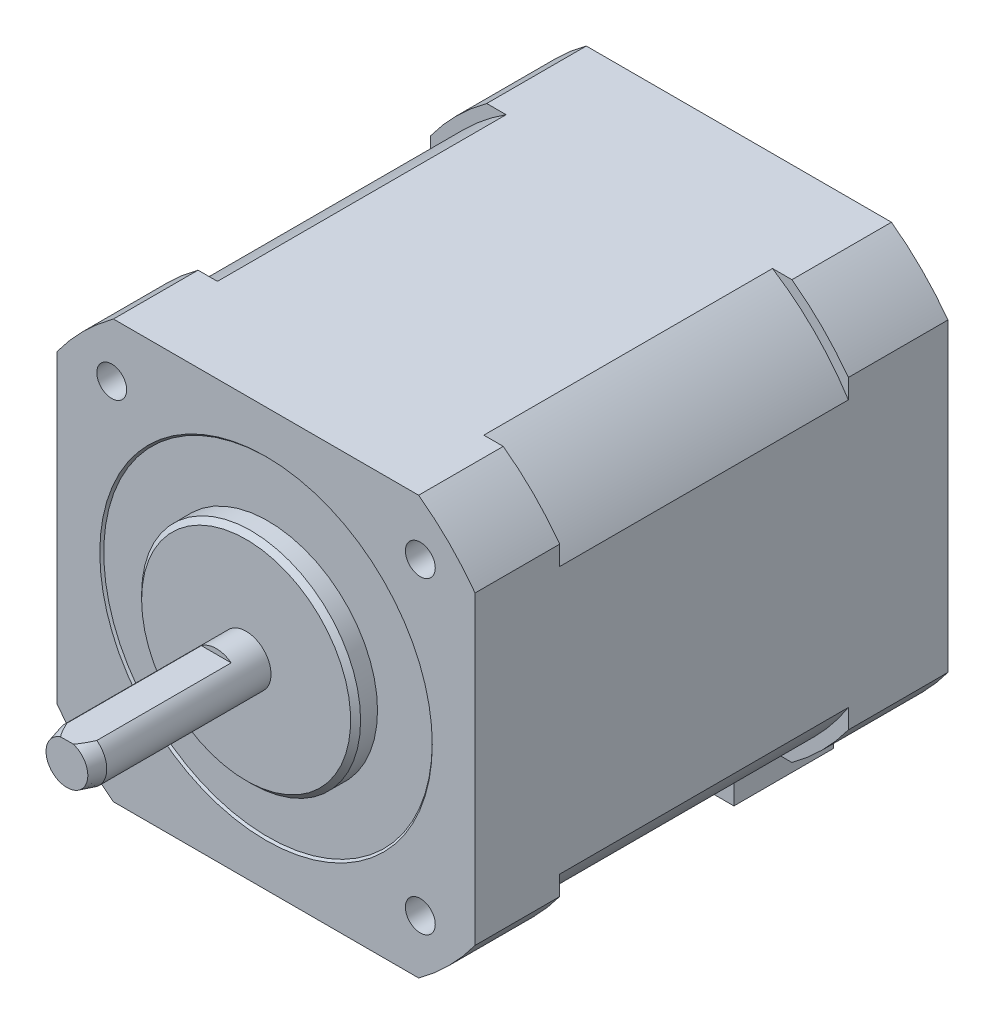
ISO-10303-21;
HEADER;
FILE_DESCRIPTION(('STEP AP214'),'2;1');
FILE_NAME('part.step','',(''),(''),'','','');
FILE_SCHEMA(('AUTOMOTIVE_DESIGN { 1 0 10303 214 1 1 1 1 }'));
ENDSEC;
DATA;
#1=APPLICATION_CONTEXT('core data for automotive mechanical design processes');
#2=APPLICATION_PROTOCOL_DEFINITION('international standard','automotive_design',2000,#1);
#3=PRODUCT_CONTEXT('',#1,'mechanical');
#4=PRODUCT('Part','Part','',(#3));
#5=PRODUCT_RELATED_PRODUCT_CATEGORY('part','',(#4));
#6=PRODUCT_DEFINITION_FORMATION('','',#4);
#7=PRODUCT_DEFINITION_CONTEXT('part definition',#1,'design');
#8=PRODUCT_DEFINITION('design','',#6,#7);
#9=PRODUCT_DEFINITION_SHAPE('','',#8);
#10=(LENGTH_UNIT() NAMED_UNIT(*) SI_UNIT(.MILLI.,.METRE.));
#11=(NAMED_UNIT(*) PLANE_ANGLE_UNIT() SI_UNIT($,.RADIAN.));
#12=(NAMED_UNIT(*) SI_UNIT($,.STERADIAN.) SOLID_ANGLE_UNIT());
#13=UNCERTAINTY_MEASURE_WITH_UNIT(LENGTH_MEASURE(1.E-05),#10,'distance_accuracy_value','');
#14=(GEOMETRIC_REPRESENTATION_CONTEXT(3) GLOBAL_UNCERTAINTY_ASSIGNED_CONTEXT((#13)) GLOBAL_UNIT_ASSIGNED_CONTEXT((#10,
#11,#12)) REPRESENTATION_CONTEXT('',''));
#15=CARTESIAN_POINT('',(0.,0.,0.));
#16=DIRECTION('',(0.,0.,1.));
#17=DIRECTION('',(1.,0.,0.));
#18=AXIS2_PLACEMENT_3D('',#15,#16,#17);
#19=CARTESIAN_POINT('',(0.,0.,-49.5));
#20=DIRECTION('',(0.,0.,-1.));
#21=DIRECTION('',(-1.,0.,0.));
#22=AXIS2_PLACEMENT_3D('',#19,#20,#21);
#23=PLANE('',#22);
#24=CARTESIAN_POINT('',(0.,0.,-49.5));
#25=DIRECTION('',(0.,0.,-1.));
#26=DIRECTION('',(-1.,0.,0.));
#27=AXIS2_PLACEMENT_3D('',#24,#25,#26);
#28=CIRCLE('',#27,2.5);
#29=CARTESIAN_POINT('',(1.5,2.,-49.5));
#30=VERTEX_POINT('',#29);
#31=CARTESIAN_POINT('',(-1.5,2.,-49.5));
#32=VERTEX_POINT('',#31);
#33=EDGE_CURVE('E284',#30,#32,#28,.T.);
#34=ORIENTED_EDGE('',*,*,#33,.F.);
#35=DIRECTION('',(-1.,0.,0.));
#36=VECTOR('',#35,1.);
#37=CARTESIAN_POINT('',(5.,2.,-49.5));
#38=LINE('',#37,#36);
#39=EDGE_CURVE('E272',#30,#32,#38,.T.);
#40=ORIENTED_EDGE('',*,*,#39,.T.);
#41=EDGE_LOOP('',(#34,#40));
#42=FACE_BOUND('',#41,.T.);
#43=CARTESIAN_POINT('',(0.,0.,-49.5));
#44=DIRECTION('',(0.,0.,-1.));
#45=DIRECTION('',(-1.,0.,0.));
#46=AXIS2_PLACEMENT_3D('',#43,#44,#45);
#47=CIRCLE('',#46,26.);
#48=CARTESIAN_POINT('',(15.3297097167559,21.,-49.5));
#49=VERTEX_POINT('',#48);
#50=CARTESIAN_POINT('',(21.,15.3297097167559,-49.5));
#51=VERTEX_POINT('',#50);
#52=EDGE_CURVE('E321',#49,#51,#47,.T.);
#53=ORIENTED_EDGE('',*,*,#52,.T.);
#54=DIRECTION('',(0.,-1.,0.));
#55=VECTOR('',#54,1.);
#56=CARTESIAN_POINT('',(21.,15.3297097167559,-49.5));
#57=LINE('',#56,#55);
#58=CARTESIAN_POINT('',(21.,-15.3297097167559,-49.5));
#59=VERTEX_POINT('',#58);
#60=EDGE_CURVE('E324',#51,#59,#57,.T.);
#61=ORIENTED_EDGE('',*,*,#60,.T.);
#62=CARTESIAN_POINT('',(0.,0.,-49.5));
#63=DIRECTION('',(0.,0.,-1.));
#64=DIRECTION('',(-1.,0.,0.));
#65=AXIS2_PLACEMENT_3D('',#62,#63,#64);
#66=CIRCLE('',#65,26.);
#67=CARTESIAN_POINT('',(15.3297097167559,-21.,-49.5));
#68=VERTEX_POINT('',#67);
#69=EDGE_CURVE('E327',#59,#68,#66,.T.);
#70=ORIENTED_EDGE('',*,*,#69,.T.);
#71=DIRECTION('',(-1.,0.,0.));
#72=VECTOR('',#71,1.);
#73=CARTESIAN_POINT('',(15.3297097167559,-21.,-49.5));
#74=LINE('',#73,#72);
#75=CARTESIAN_POINT('',(9.5,-21.,-49.5));
#76=VERTEX_POINT('',#75);
#77=EDGE_CURVE('E338',#68,#76,#74,.T.);
#78=ORIENTED_EDGE('',*,*,#77,.T.);
#79=DIRECTION('',(0.,1.,0.));
#80=VECTOR('',#79,1.);
#81=CARTESIAN_POINT('',(9.5,-27.7,-49.5));
#82=LINE('',#81,#80);
#83=CARTESIAN_POINT('',(9.5,-27.7,-49.5));
#84=VERTEX_POINT('',#83);
#85=EDGE_CURVE('E301',#84,#76,#82,.T.);
#86=ORIENTED_EDGE('',*,*,#85,.F.);
#87=DIRECTION('',(1.,0.,0.));
#88=VECTOR('',#87,1.);
#89=CARTESIAN_POINT('',(-9.5,-27.7,-49.5));
#90=LINE('',#89,#88);
#91=CARTESIAN_POINT('',(-9.5,-27.7,-49.5));
#92=VERTEX_POINT('',#91);
#93=EDGE_CURVE('E817',#92,#84,#90,.T.);
#94=ORIENTED_EDGE('',*,*,#93,.F.);
#95=DIRECTION('',(0.,1.,0.));
#96=VECTOR('',#95,1.);
#97=CARTESIAN_POINT('',(-9.5,-27.7,-49.5));
#98=LINE('',#97,#96);
#99=CARTESIAN_POINT('',(-9.5,-21.0000000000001,-49.5));
#100=VERTEX_POINT('',#99);
#101=EDGE_CURVE('E306',#92,#100,#98,.T.);
#102=ORIENTED_EDGE('',*,*,#101,.T.);
#103=CARTESIAN_POINT('',(-15.3297097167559,-21.,-49.5));
#104=VERTEX_POINT('',#103);
#105=EDGE_CURVE('E329',#100,#104,#74,.T.);
#106=ORIENTED_EDGE('',*,*,#105,.T.);
#107=CARTESIAN_POINT('',(0.,0.,-49.5));
#108=DIRECTION('',(0.,0.,-1.));
#109=DIRECTION('',(-1.,0.,0.));
#110=AXIS2_PLACEMENT_3D('',#107,#108,#109);
#111=CIRCLE('',#110,26.);
#112=CARTESIAN_POINT('',(-21.,-15.3297097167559,-49.5));
#113=VERTEX_POINT('',#112);
#114=EDGE_CURVE('E332',#104,#113,#111,.T.);
#115=ORIENTED_EDGE('',*,*,#114,.T.);
#116=DIRECTION('',(0.,1.,0.));
#117=VECTOR('',#116,1.);
#118=CARTESIAN_POINT('',(-21.,-15.3297097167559,-49.5));
#119=LINE('',#118,#117);
#120=CARTESIAN_POINT('',(-21.,15.3297097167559,-49.5));
#121=VERTEX_POINT('',#120);
#122=EDGE_CURVE('E786',#113,#121,#119,.T.);
#123=ORIENTED_EDGE('',*,*,#122,.T.);
#124=CARTESIAN_POINT('',(0.,0.,-49.5));
#125=DIRECTION('',(0.,0.,-1.));
#126=DIRECTION('',(-1.,0.,0.));
#127=AXIS2_PLACEMENT_3D('',#124,#125,#126);
#128=CIRCLE('',#127,26.);
#129=CARTESIAN_POINT('',(-15.3297097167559,21.,-49.5));
#130=VERTEX_POINT('',#129);
#131=EDGE_CURVE('E784',#121,#130,#128,.T.);
#132=ORIENTED_EDGE('',*,*,#131,.T.);
#133=DIRECTION('',(1.,0.,0.));
#134=VECTOR('',#133,1.);
#135=CARTESIAN_POINT('',(-15.3297097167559,21.,-49.5));
#136=LINE('',#135,#134);
#137=EDGE_CURVE('E779',#130,#49,#136,.T.);
#138=ORIENTED_EDGE('',*,*,#137,.T.);
#139=EDGE_LOOP('',(#53,#61,#70,#78,#86,#94,#102,#106,#115,#123,#132,#138));
#140=FACE_BOUND('',#139,.T.);
#141=ADVANCED_FACE('F38',(#42,#140),#23,.T.);
#142=CARTESIAN_POINT('',(21.,-21.,-10.5));
#143=DIRECTION('',(0.,1.,0.));
#144=DIRECTION('',(-1.,0.,0.));
#145=AXIS2_PLACEMENT_3D('',#142,#143,#144);
#146=PLANE('',#145);
#147=DIRECTION('',(0.,0.,-1.));
#148=VECTOR('',#147,1.);
#149=CARTESIAN_POINT('',(-9.5,-21.,-39.5));
#150=LINE('',#149,#148);
#151=CARTESIAN_POINT('',(-9.5,-21.,-39.5));
#152=VERTEX_POINT('',#151);
#153=EDGE_CURVE('E65',#152,#100,#150,.T.);
#154=ORIENTED_EDGE('',*,*,#153,.F.);
#155=DIRECTION('',(-1.,0.,0.));
#156=VECTOR('',#155,1.);
#157=CARTESIAN_POINT('',(-9.5,-21.,-39.5));
#158=LINE('',#157,#156);
#159=CARTESIAN_POINT('',(9.5,-21.,-39.5));
#160=VERTEX_POINT('',#159);
#161=EDGE_CURVE('E292',#160,#152,#158,.T.);
#162=ORIENTED_EDGE('',*,*,#161,.F.);
#163=DIRECTION('',(0.,0.,1.));
#164=VECTOR('',#163,1.);
#165=CARTESIAN_POINT('',(9.5,-21.,-39.5));
#166=LINE('',#165,#164);
#167=EDGE_CURVE('E283',#76,#160,#166,.T.);
#168=ORIENTED_EDGE('',*,*,#167,.F.);
#169=ORIENTED_EDGE('',*,*,#77,.F.);
#170=DIRECTION('',(0.,0.,1.));
#171=VECTOR('',#170,1.);
#172=CARTESIAN_POINT('',(15.3297097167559,-21.,-49.5));
#173=LINE('',#172,#171);
#174=CARTESIAN_POINT('',(15.3297097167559,-21.,-39.5));
#175=VERTEX_POINT('',#174);
#176=EDGE_CURVE('E764',#68,#175,#173,.T.);
#177=ORIENTED_EDGE('',*,*,#176,.T.);
#178=DIRECTION('',(-1.,0.,0.));
#179=VECTOR('',#178,1.);
#180=CARTESIAN_POINT('',(-13.3794618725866,-21.,-39.5));
#181=LINE('',#180,#179);
#182=CARTESIAN_POINT('',(13.3794618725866,-21.,-39.5));
#183=VERTEX_POINT('',#182);
#184=EDGE_CURVE('E741',#175,#183,#181,.T.);
#185=ORIENTED_EDGE('',*,*,#184,.T.);
#186=DIRECTION('',(0.,0.,1.));
#187=VECTOR('',#186,1.);
#188=CARTESIAN_POINT('',(13.3794618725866,-21.,-39.5));
#189=LINE('',#188,#187);
#190=CARTESIAN_POINT('',(13.3794618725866,-21.,-10.5));
#191=VERTEX_POINT('',#190);
#192=EDGE_CURVE('E599',#183,#191,#189,.T.);
#193=ORIENTED_EDGE('',*,*,#192,.T.);
#194=DIRECTION('',(-1.,0.,0.));
#195=VECTOR('',#194,1.);
#196=CARTESIAN_POINT('',(21.,-21.,-10.5));
#197=LINE('',#196,#195);
#198=CARTESIAN_POINT('',(15.3297097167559,-21.,-10.5));
#199=VERTEX_POINT('',#198);
#200=EDGE_CURVE('E503',#199,#191,#197,.T.);
#201=ORIENTED_EDGE('',*,*,#200,.F.);
#202=DIRECTION('',(0.,0.,1.));
#203=VECTOR('',#202,1.);
#204=CARTESIAN_POINT('',(15.3297097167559,-21.,-36.));
#205=LINE('',#204,#203);
#206=CARTESIAN_POINT('',(15.3297097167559,-21.,-2.));
#207=VERTEX_POINT('',#206);
#208=EDGE_CURVE('E567',#207,#199,#205,.F.);
#209=ORIENTED_EDGE('',*,*,#208,.F.);
#210=DIRECTION('',(-1.,0.,0.));
#211=VECTOR('',#210,1.);
#212=CARTESIAN_POINT('',(21.,-21.,-2.));
#213=LINE('',#212,#211);
#214=CARTESIAN_POINT('',(-15.3297097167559,-21.,-2.));
#215=VERTEX_POINT('',#214);
#216=EDGE_CURVE('E512',#207,#215,#213,.T.);
#217=ORIENTED_EDGE('',*,*,#216,.T.);
#218=DIRECTION('',(0.,0.,1.));
#219=VECTOR('',#218,1.);
#220=CARTESIAN_POINT('',(-15.3297097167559,-21.,-36.));
#221=LINE('',#220,#219);
#222=CARTESIAN_POINT('',(-15.3297097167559,-21.,-10.5));
#223=VERTEX_POINT('',#222);
#224=EDGE_CURVE('E571',#223,#215,#221,.T.);
#225=ORIENTED_EDGE('',*,*,#224,.F.);
#226=CARTESIAN_POINT('',(-13.3794618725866,-21.,-10.5));
#227=VERTEX_POINT('',#226);
#228=EDGE_CURVE('E509',#227,#223,#197,.T.);
#229=ORIENTED_EDGE('',*,*,#228,.F.);
#230=DIRECTION('',(0.,0.,1.));
#231=VECTOR('',#230,1.);
#232=CARTESIAN_POINT('',(-13.3794618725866,-21.,-39.5));
#233=LINE('',#232,#231);
#234=CARTESIAN_POINT('',(-13.3794618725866,-21.,-39.5));
#235=VERTEX_POINT('',#234);
#236=EDGE_CURVE('E1276',#235,#227,#233,.T.);
#237=ORIENTED_EDGE('',*,*,#236,.F.);
#238=CARTESIAN_POINT('',(-15.3297097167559,-21.,-39.5));
#239=VERTEX_POINT('',#238);
#240=EDGE_CURVE('E734',#235,#239,#181,.T.);
#241=ORIENTED_EDGE('',*,*,#240,.T.);
#242=DIRECTION('',(0.,0.,1.));
#243=VECTOR('',#242,1.);
#244=CARTESIAN_POINT('',(-15.3297097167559,-21.,-49.5));
#245=LINE('',#244,#243);
#246=EDGE_CURVE('E767',#104,#239,#245,.T.);
#247=ORIENTED_EDGE('',*,*,#246,.F.);
#248=ORIENTED_EDGE('',*,*,#105,.F.);
#249=EDGE_LOOP('',(#154,#162,#168,#169,#177,#185,#193,#201,#209,#217,#225,#229,#237,#241,#247,#248));
#250=FACE_BOUND('',#249,.T.);
#251=ADVANCED_FACE('F373',(#250),#146,.F.);
#252=CARTESIAN_POINT('',(0.,0.,18.));
#253=DIRECTION('',(0.,0.,-1.));
#254=DIRECTION('',(-1.,0.,0.));
#255=AXIS2_PLACEMENT_3D('',#252,#253,#254);
#256=CYLINDRICAL_SURFACE('',#255,2.5);
#257=CARTESIAN_POINT('',(0.,0.,16.5000000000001));
#258=DIRECTION('',(0.,0.,1.));
#259=DIRECTION('',(1.,0.,0.));
#260=AXIS2_PLACEMENT_3D('',#257,#258,#259);
#261=CIRCLE('',#260,2.5);
#262=CARTESIAN_POINT('',(1.5,2.,16.5000000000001));
#263=VERTEX_POINT('',#262);
#264=CARTESIAN_POINT('',(-1.49999999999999,2.,16.5000000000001));
#265=VERTEX_POINT('',#264);
#266=EDGE_CURVE('E356',#263,#265,#261,.F.);
#267=ORIENTED_EDGE('',*,*,#266,.T.);
#268=DIRECTION('',(0.,0.,-1.));
#269=VECTOR('',#268,1.);
#270=CARTESIAN_POINT('',(-1.5,2.,18.));
#271=LINE('',#270,#269);
#272=CARTESIAN_POINT('',(-1.5,2.,3.));
#273=VERTEX_POINT('',#272);
#274=EDGE_CURVE('E317',#265,#273,#271,.T.);
#275=ORIENTED_EDGE('',*,*,#274,.T.);
#276=CARTESIAN_POINT('',(0.,0.,3.));
#277=DIRECTION('',(0.,0.,1.));
#278=DIRECTION('',(1.,0.,0.));
#279=AXIS2_PLACEMENT_3D('',#276,#277,#278);
#280=CIRCLE('',#279,2.5);
#281=CARTESIAN_POINT('',(1.5,2.,3.));
#282=VERTEX_POINT('',#281);
#283=EDGE_CURVE('E346',#282,#273,#280,.T.);
#284=ORIENTED_EDGE('',*,*,#283,.F.);
#285=DIRECTION('',(0.,0.,-1.));
#286=VECTOR('',#285,1.);
#287=CARTESIAN_POINT('',(1.5,2.,18.));
#288=LINE('',#287,#286);
#289=EDGE_CURVE('E313',#282,#263,#288,.F.);
#290=ORIENTED_EDGE('',*,*,#289,.T.);
#291=EDGE_LOOP('',(#267,#275,#284,#290));
#292=FACE_BOUND('',#291,.T.);
#293=CARTESIAN_POINT('',(0.,0.,0.));
#294=DIRECTION('',(0.,0.,-1.));
#295=DIRECTION('',(-1.,0.,0.));
#296=AXIS2_PLACEMENT_3D('',#293,#294,#295);
#297=CIRCLE('',#296,2.5);
#298=CARTESIAN_POINT('',(-2.5,0.,0.));
#299=VERTEX_POINT('',#298);
#300=EDGE_CURVE('E500',#299,#299,#297,.T.);
#301=ORIENTED_EDGE('',*,*,#300,.F.);
#302=EDGE_LOOP('',(#301));
#303=FACE_BOUND('',#302,.T.);
#304=ADVANCED_FACE('F468',(#292,#303),#256,.T.);
#305=CARTESIAN_POINT('',(0.,0.,18.));
#306=DIRECTION('',(0.,0.,1.));
#307=DIRECTION('',(1.,0.,0.));
#308=AXIS2_PLACEMENT_3D('',#305,#306,#307);
#309=PLANE('',#308);
#310=DIRECTION('',(1.,0.,0.));
#311=VECTOR('',#310,1.);
#312=CARTESIAN_POINT('',(-4.72781232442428,2.,18.));
#313=LINE('',#312,#311);
#314=CARTESIAN_POINT('',(-0.633974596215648,2.,18.));
#315=VERTEX_POINT('',#314);
#316=CARTESIAN_POINT('',(0.633974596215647,2.,18.));
#317=VERTEX_POINT('',#316);
#318=EDGE_CURVE('E309',#315,#317,#313,.T.);
#319=ORIENTED_EDGE('',*,*,#318,.F.);
#320=CARTESIAN_POINT('',(0.,0.,18.));
#321=DIRECTION('',(0.,0.,1.));
#322=DIRECTION('',(1.,0.,0.));
#323=AXIS2_PLACEMENT_3D('',#320,#321,#322);
#324=CIRCLE('',#323,2.09807621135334);
#325=EDGE_CURVE('E1241',#315,#317,#324,.T.);
#326=ORIENTED_EDGE('',*,*,#325,.T.);
#327=EDGE_LOOP('',(#319,#326));
#328=FACE_BOUND('',#327,.T.);
#329=ADVANCED_FACE('F484',(#328),#309,.T.);
#330=CARTESIAN_POINT('',(0.,0.,0.));
#331=DIRECTION('',(0.,0.,-1.));
#332=DIRECTION('',(-1.,0.,0.));
#333=AXIS2_PLACEMENT_3D('',#330,#331,#332);
#334=PLANE('',#333);
#335=CARTESIAN_POINT('',(0.,0.,0.));
#336=DIRECTION('',(0.,0.,-1.));
#337=DIRECTION('',(-1.,0.,0.));
#338=AXIS2_PLACEMENT_3D('',#335,#336,#337);
#339=CIRCLE('',#338,10.5);
#340=CARTESIAN_POINT('',(-10.5,0.,0.));
#341=VERTEX_POINT('',#340);
#342=EDGE_CURVE('E278',#341,#341,#339,.F.);
#343=ORIENTED_EDGE('',*,*,#342,.T.);
#344=EDGE_LOOP('',(#343));
#345=FACE_BOUND('',#344,.T.);
#346=ORIENTED_EDGE('',*,*,#300,.T.);
#347=EDGE_LOOP('',(#346));
#348=FACE_BOUND('',#347,.T.);
#349=ADVANCED_FACE('F480',(#345,#348),#334,.F.);
#350=CARTESIAN_POINT('',(0.,0.,-2.));
#351=DIRECTION('',(0.,0.,1.));
#352=DIRECTION('',(1.,0.,0.));
#353=AXIS2_PLACEMENT_3D('',#350,#351,#352);
#354=CYLINDRICAL_SURFACE('',#353,11.);
#355=CARTESIAN_POINT('',(0.,0.,-0.500000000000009));
#356=DIRECTION('',(0.,0.,-1.));
#357=DIRECTION('',(-1.,0.,0.));
#358=AXIS2_PLACEMENT_3D('',#355,#356,#357);
#359=CIRCLE('',#358,11.);
#360=CARTESIAN_POINT('',(-11.,0.,-0.500000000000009));
#361=VERTEX_POINT('',#360);
#362=EDGE_CURVE('E343',#361,#361,#359,.T.);
#363=ORIENTED_EDGE('',*,*,#362,.T.);
#364=EDGE_LOOP('',(#363));
#365=FACE_BOUND('',#364,.T.);
#366=CARTESIAN_POINT('',(0.,0.,-2.2));
#367=DIRECTION('',(0.,0.,1.));
#368=DIRECTION('',(1.,0.,0.));
#369=AXIS2_PLACEMENT_3D('',#366,#367,#368);
#370=CIRCLE('',#369,11.);
#371=CARTESIAN_POINT('',(11.,0.,-2.2));
#372=VERTEX_POINT('',#371);
#373=EDGE_CURVE('E302',#372,#372,#370,.T.);
#374=ORIENTED_EDGE('',*,*,#373,.T.);
#375=EDGE_LOOP('',(#374));
#376=FACE_BOUND('',#375,.T.);
#377=ADVANCED_FACE('F483',(#365,#376),#354,.T.);
#378=CARTESIAN_POINT('',(0.,0.,18.));
#379=DIRECTION('',(0.,0.,-1.));
#380=DIRECTION('',(-1.,0.,0.));
#381=AXIS2_PLACEMENT_3D('',#378,#379,#380);
#382=CONICAL_SURFACE('',#381,2.09807621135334,0.261799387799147);
#383=CARTESIAN_POINT('',(-2.67411513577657,2.,13.3677080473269));
#384=CARTESIAN_POINT('',(-2.63311786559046,2.,13.4902257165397));
#385=CARTESIAN_POINT('',(-2.59182160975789,2.,13.6126436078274));
#386=CARTESIAN_POINT('',(-2.50853023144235,2.,13.8572444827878));
#387=CARTESIAN_POINT('',(-2.46653509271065,2.,13.9794274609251));
#388=CARTESIAN_POINT('',(-2.33928264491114,2.,14.3457646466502));
#389=CARTESIAN_POINT('',(-2.25282589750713,2.,14.5895039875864));
#390=CARTESIAN_POINT('',(-2.07457613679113,2.,15.0781045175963));
#391=CARTESIAN_POINT('',(-1.98273458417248,2.,15.3229481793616));
#392=CARTESIAN_POINT('',(-1.84011140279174,2.,15.6882620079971));
#393=CARTESIAN_POINT('',(-1.79177038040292,2.,15.8096838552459));
#394=CARTESIAN_POINT('',(-1.69305456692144,2.,16.0516959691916));
#395=CARTESIAN_POINT('',(-1.64267985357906,2.,16.1722862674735));
#396=CARTESIAN_POINT('',(-1.53950262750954,2.,16.4120087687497));
#397=CARTESIAN_POINT('',(-1.48670769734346,2.,16.5311442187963));
#398=CARTESIAN_POINT('',(-1.37773401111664,2.,16.7679408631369));
#399=CARTESIAN_POINT('',(-1.32155357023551,2.,16.8856012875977));
#400=CARTESIAN_POINT('',(-1.20458285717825,2.,17.1187131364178));
#401=CARTESIAN_POINT('',(-1.14379017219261,2.,17.2341633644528));
#402=CARTESIAN_POINT('',(-1.01570284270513,2.,17.4612984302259));
#403=CARTESIAN_POINT('',(-0.948415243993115,2.,17.5729871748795));
#404=CARTESIAN_POINT('',(-0.817363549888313,2.,17.7692701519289));
#405=CARTESIAN_POINT('',(-0.755348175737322,2.,17.8549879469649));
#406=CARTESIAN_POINT('',(-0.654778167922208,2.,17.9770588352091));
#407=CARTESIAN_POINT('',(-0.620094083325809,2.,18.0165731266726));
#408=CARTESIAN_POINT('',(-0.547506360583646,2.,18.0924930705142));
#409=CARTESIAN_POINT('',(-0.509607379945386,2.,18.128903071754));
#410=CARTESIAN_POINT('',(-0.439829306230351,2.,18.1884315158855));
#411=CARTESIAN_POINT('',(-0.40884422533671,2.,18.2125855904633));
#412=CARTESIAN_POINT('',(-0.344218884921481,2.,18.2572111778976));
#413=CARTESIAN_POINT('',(-0.310575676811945,2.,18.2776785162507));
#414=CARTESIAN_POINT('',(-0.240012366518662,2.,18.3136158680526));
#415=CARTESIAN_POINT('',(-0.203051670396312,2.,18.3290087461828));
#416=CARTESIAN_POINT('',(-0.126881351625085,2.,18.3523462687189));
#417=CARTESIAN_POINT('',(-0.0876800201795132,2.,18.3603166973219));
#418=CARTESIAN_POINT('',(-0.0127311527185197,2.,18.3670397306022));
#419=CARTESIAN_POINT('',(0.0229341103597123,2.,18.3666919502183));
#420=CARTESIAN_POINT('',(0.0935290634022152,2.,18.3590326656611));
#421=CARTESIAN_POINT('',(0.128457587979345,2.,18.351710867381));
#422=CARTESIAN_POINT('',(0.201815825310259,2.,18.3295534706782));
#423=CARTESIAN_POINT('',(0.239935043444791,2.,18.3137192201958));
#424=CARTESIAN_POINT('',(0.313185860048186,2.,18.2762831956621));
#425=CARTESIAN_POINT('',(0.348311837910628,2.,18.2546708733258));
#426=CARTESIAN_POINT('',(0.443923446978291,2.,18.1877621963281));
#427=CARTESIAN_POINT('',(0.501075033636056,2.,18.1377652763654));
#428=CARTESIAN_POINT('',(0.581429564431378,2.,18.0575943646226));
#429=CARTESIAN_POINT('',(0.607372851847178,2.,18.0299378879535));
#430=CARTESIAN_POINT('',(0.657731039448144,2.,17.9732675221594));
#431=CARTESIAN_POINT('',(0.68214664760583,2.,17.9442542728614));
#432=CARTESIAN_POINT('',(0.749893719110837,2.,17.8601101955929));
#433=CARTESIAN_POINT('',(0.791668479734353,2.,17.8037362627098));
#434=CARTESIAN_POINT('',(0.8719398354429,2.,17.6886841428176));
#435=CARTESIAN_POINT('',(0.91043426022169,2.,17.6300044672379));
#436=CARTESIAN_POINT('',(0.984949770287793,2.,17.5109259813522));
#437=CARTESIAN_POINT('',(1.02096523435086,2.,17.4505236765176));
#438=CARTESIAN_POINT('',(1.09096213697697,2.,17.3285472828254));
#439=CARTESIAN_POINT('',(1.12494324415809,2.,17.2669730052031));
#440=CARTESIAN_POINT('',(1.22495399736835,2.,17.0799665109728));
#441=CARTESIAN_POINT('',(1.28847862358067,2.,16.9531970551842));
#442=CARTESIAN_POINT('',(1.41085483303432,2.,16.6976781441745));
#443=CARTESIAN_POINT('',(1.46971282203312,2.,16.5689317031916));
#444=CARTESIAN_POINT('',(1.58310001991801,2.,16.3121463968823));
#445=CARTESIAN_POINT('',(1.63768554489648,2.,16.1841322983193));
#446=CARTESIAN_POINT('',(1.74436311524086,2.,15.9270663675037));
#447=CARTESIAN_POINT('',(1.7964550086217,2.,15.7980144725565));
#448=CARTESIAN_POINT('',(1.94989108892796,2.,15.4094944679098));
#449=CARTESIAN_POINT('',(2.04830566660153,2.,15.1488712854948));
#450=CARTESIAN_POINT('',(2.23648040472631,2.,14.6352664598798));
#451=CARTESIAN_POINT('',(2.32642514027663,2.,14.3823515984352));
#452=CARTESIAN_POINT('',(2.45867006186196,2.,14.0022493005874));
#453=CARTESIAN_POINT('',(2.50227709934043,2.,13.875514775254));
#454=CARTESIAN_POINT('',(2.58873482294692,2.,13.6217918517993));
#455=CARTESIAN_POINT('',(2.63158553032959,2.,13.4948034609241));
#456=CARTESIAN_POINT('',(2.67411513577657,2.,13.3677080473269));
#457=B_SPLINE_CURVE_WITH_KNOTS('',3,(#383,#384,#385,#386,#387,#388,#389,#390,#391,#392,#393,
#394,#395,#396,#397,#398,#399,#400,#401,#402,#403,#404,#405,#406,#407,#408,#409,#410,#411,#412,
#413,#414,#415,#416,#417,#418,#419,#420,#421,#422,#423,#424,#425,#426,#427,#428,#429,#430,#431,
#432,#433,#434,#435,#436,#437,#438,#439,#440,#441,#442,#443,#444,#445,#446,#447,#448,#449,#450,
#451,#452,#453,#454,#455,#456),.UNSPECIFIED.,.F.,.F.,(4,2,2,2,2,2,2,2,2,2,2,2,2,2,2,2,2,2,2,2,2,
2,2,2,2,2,2,2,2,2,2,2,2,2,2,2,4),(0.,0.387584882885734,0.775178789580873,1.55100876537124,
2.33544116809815,2.72750017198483,3.11954420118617,3.51043426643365,3.90152049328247,
4.29281273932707,4.68368517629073,5.00048531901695,5.15809093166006,5.31547199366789,
5.43314149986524,5.55094341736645,5.67046127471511,5.78956238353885,5.89584731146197,
6.00228936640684,6.12543181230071,6.24880061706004,6.47525140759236,6.58900607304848,
6.70270762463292,6.91302983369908,7.1234901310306,7.33441292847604,7.54536999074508,
7.97059745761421,8.39523074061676,8.81269313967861,9.23018095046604,10.0658395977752,
10.8711084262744,11.2731870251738,11.6752543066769),.UNSPECIFIED.);
#458=EDGE_CURVE('E348',#265,#315,#457,.T.);
#459=ORIENTED_EDGE('',*,*,#458,.F.);
#460=ORIENTED_EDGE('',*,*,#266,.F.);
#461=EDGE_CURVE('E349',#317,#263,#457,.T.);
#462=ORIENTED_EDGE('',*,*,#461,.F.);
#463=ORIENTED_EDGE('',*,*,#325,.F.);
#464=EDGE_LOOP('',(#459,#460,#462,#463));
#465=FACE_BOUND('',#464,.T.);
#466=ADVANCED_FACE('F358',(#465),#382,.T.);
#467=CARTESIAN_POINT('',(0.,0.,3.));
#468=DIRECTION('',(0.,0.,1.));
#469=DIRECTION('',(1.,0.,0.));
#470=AXIS2_PLACEMENT_3D('',#467,#468,#469);
#471=PLANE('',#470);
#472=ORIENTED_EDGE('',*,*,#283,.T.);
#473=DIRECTION('',(1.,0.,0.));
#474=VECTOR('',#473,1.);
#475=CARTESIAN_POINT('',(-4.72781232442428,2.,3.));
#476=LINE('',#475,#474);
#477=EDGE_CURVE('E310',#273,#282,#476,.T.);
#478=ORIENTED_EDGE('',*,*,#477,.T.);
#479=EDGE_LOOP('',(#472,#478));
#480=FACE_BOUND('',#479,.T.);
#481=ADVANCED_FACE('F368',(#480),#471,.T.);
#482=CARTESIAN_POINT('',(-4.72781232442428,2.,3.));
#483=DIRECTION('',(0.,-1.,0.));
#484=DIRECTION('',(0.,0.,-1.));
#485=AXIS2_PLACEMENT_3D('',#482,#483,#484);
#486=PLANE('',#485);
#487=ORIENTED_EDGE('',*,*,#458,.T.);
#488=ORIENTED_EDGE('',*,*,#318,.T.);
#489=ORIENTED_EDGE('',*,*,#461,.T.);
#490=ORIENTED_EDGE('',*,*,#289,.F.);
#491=ORIENTED_EDGE('',*,*,#477,.F.);
#492=ORIENTED_EDGE('',*,*,#274,.F.);
#493=EDGE_LOOP('',(#487,#488,#489,#490,#491,#492));
#494=FACE_BOUND('',#493,.T.);
#495=ADVANCED_FACE('F362',(#494),#486,.F.);
#496=CARTESIAN_POINT('',(0.,0.,-2.2));
#497=DIRECTION('',(0.,0.,1.));
#498=DIRECTION('',(1.,0.,0.));
#499=AXIS2_PLACEMENT_3D('',#496,#497,#498);
#500=PLANE('',#499);
#501=ORIENTED_EDGE('',*,*,#373,.F.);
#502=EDGE_LOOP('',(#501));
#503=FACE_BOUND('',#502,.T.);
#504=CARTESIAN_POINT('',(0.,0.,-2.2));
#505=DIRECTION('',(0.,0.,1.));
#506=DIRECTION('',(1.,0.,0.));
#507=AXIS2_PLACEMENT_3D('',#504,#505,#506);
#508=CIRCLE('',#507,16.5);
#509=CARTESIAN_POINT('',(16.5,0.,-2.2));
#510=VERTEX_POINT('',#509);
#511=EDGE_CURVE('E305',#510,#510,#508,.T.);
#512=ORIENTED_EDGE('',*,*,#511,.T.);
#513=EDGE_LOOP('',(#512));
#514=FACE_BOUND('',#513,.T.);
#515=ADVANCED_FACE('F367',(#503,#514),#500,.T.);
#516=CARTESIAN_POINT('',(-21.,-21.,-10.5));
#517=DIRECTION('',(0.,0.,-1.));
#518=DIRECTION('',(-1.,0.,0.));
#519=AXIS2_PLACEMENT_3D('',#516,#517,#518);
#520=PLANE('',#519);
#521=CARTESIAN_POINT('',(0.,0.,-10.5));
#522=DIRECTION('',(0.,0.,-1.));
#523=DIRECTION('',(-1.,0.,0.));
#524=AXIS2_PLACEMENT_3D('',#521,#522,#523);
#525=CIRCLE('',#524,24.9);
#526=CARTESIAN_POINT('',(13.3794618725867,21.,-10.5));
#527=VERTEX_POINT('',#526);
#528=CARTESIAN_POINT('',(21.,13.3794618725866,-10.5));
#529=VERTEX_POINT('',#528);
#530=EDGE_CURVE('E549',#527,#529,#525,.T.);
#531=ORIENTED_EDGE('',*,*,#530,.F.);
#532=DIRECTION('',(1.,0.,0.));
#533=VECTOR('',#532,1.);
#534=CARTESIAN_POINT('',(21.,21.,-10.5));
#535=LINE('',#534,#533);
#536=CARTESIAN_POINT('',(15.3297097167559,21.,-10.5));
#537=VERTEX_POINT('',#536);
#538=EDGE_CURVE('E518',#527,#537,#535,.T.);
#539=ORIENTED_EDGE('',*,*,#538,.T.);
#540=CARTESIAN_POINT('',(0.,0.,-10.5));
#541=DIRECTION('',(0.,0.,-1.));
#542=DIRECTION('',(-1.,0.,0.));
#543=AXIS2_PLACEMENT_3D('',#540,#541,#542);
#544=CIRCLE('',#543,26.);
#545=CARTESIAN_POINT('',(21.,15.3297097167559,-10.5));
#546=VERTEX_POINT('',#545);
#547=EDGE_CURVE('E546',#537,#546,#544,.T.);
#548=ORIENTED_EDGE('',*,*,#547,.T.);
#549=DIRECTION('',(0.,-1.,0.));
#550=VECTOR('',#549,1.);
#551=CARTESIAN_POINT('',(21.,21.,-10.5));
#552=LINE('',#551,#550);
#553=EDGE_CURVE('E540',#546,#529,#552,.T.);
#554=ORIENTED_EDGE('',*,*,#553,.T.);
#555=EDGE_LOOP('',(#531,#539,#548,#554));
#556=FACE_BOUND('',#555,.T.);
#557=ADVANCED_FACE('F404',(#556),#520,.T.);
#558=CARTESIAN_POINT('',(0.,0.,-39.5));
#559=DIRECTION('',(0.,0.,1.));
#560=DIRECTION('',(1.,0.,0.));
#561=AXIS2_PLACEMENT_3D('',#558,#559,#560);
#562=CYLINDRICAL_SURFACE('',#561,24.9);
#563=ORIENTED_EDGE('',*,*,#530,.T.);
#564=DIRECTION('',(0.,0.,1.));
#565=VECTOR('',#564,1.);
#566=CARTESIAN_POINT('',(21.,13.3794618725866,-39.5));
#567=LINE('',#566,#565);
#568=CARTESIAN_POINT('',(21.0000000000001,13.3794618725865,-39.5));
#569=VERTEX_POINT('',#568);
#570=EDGE_CURVE('E613',#569,#529,#567,.T.);
#571=ORIENTED_EDGE('',*,*,#570,.F.);
#572=CARTESIAN_POINT('',(0.,0.,-39.5));
#573=DIRECTION('',(0.,0.,-1.));
#574=DIRECTION('',(-1.,0.,0.));
#575=AXIS2_PLACEMENT_3D('',#572,#573,#574);
#576=CIRCLE('',#575,24.9);
#577=CARTESIAN_POINT('',(13.3794618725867,21.,-39.5));
#578=VERTEX_POINT('',#577);
#579=EDGE_CURVE('E636',#578,#569,#576,.T.);
#580=ORIENTED_EDGE('',*,*,#579,.F.);
#581=DIRECTION('',(0.,0.,1.));
#582=VECTOR('',#581,1.);
#583=CARTESIAN_POINT('',(13.3794618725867,21.,-39.5));
#584=LINE('',#583,#582);
#585=EDGE_CURVE('E616',#578,#527,#584,.T.);
#586=ORIENTED_EDGE('',*,*,#585,.T.);
#587=EDGE_LOOP('',(#563,#571,#580,#586));
#588=FACE_BOUND('',#587,.T.);
#589=ADVANCED_FACE('F401',(#588),#562,.T.);
#590=CARTESIAN_POINT('',(0.,0.,-39.5));
#591=DIRECTION('',(0.,0.,-1.));
#592=DIRECTION('',(-1.,0.,0.));
#593=AXIS2_PLACEMENT_3D('',#590,#591,#592);
#594=PLANE('',#593);
#595=DIRECTION('',(1.,0.,0.));
#596=VECTOR('',#595,1.);
#597=CARTESIAN_POINT('',(13.3794618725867,21.,-39.5));
#598=LINE('',#597,#596);
#599=CARTESIAN_POINT('',(15.3297097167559,21.,-39.5));
#600=VERTEX_POINT('',#599);
#601=EDGE_CURVE('E752',#578,#600,#598,.T.);
#602=ORIENTED_EDGE('',*,*,#601,.F.);
#603=ORIENTED_EDGE('',*,*,#579,.T.);
#604=DIRECTION('',(0.,-1.,0.));
#605=VECTOR('',#604,1.);
#606=CARTESIAN_POINT('',(21.,-13.3794618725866,-39.5));
#607=LINE('',#606,#605);
#608=CARTESIAN_POINT('',(21.,15.3297097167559,-39.5));
#609=VERTEX_POINT('',#608);
#610=EDGE_CURVE('E724',#609,#569,#607,.T.);
#611=ORIENTED_EDGE('',*,*,#610,.F.);
#612=CARTESIAN_POINT('',(0.,0.,-39.5));
#613=DIRECTION('',(0.,0.,-1.));
#614=DIRECTION('',(-1.,0.,0.));
#615=AXIS2_PLACEMENT_3D('',#612,#613,#614);
#616=CIRCLE('',#615,26.);
#617=EDGE_CURVE('E320',#600,#609,#616,.T.);
#618=ORIENTED_EDGE('',*,*,#617,.F.);
#619=EDGE_LOOP('',(#602,#603,#611,#618));
#620=FACE_BOUND('',#619,.T.);
#621=ADVANCED_FACE('F382',(#620),#594,.F.);
#622=CARTESIAN_POINT('',(0.,0.,-49.5));
#623=DIRECTION('',(0.,0.,1.));
#624=DIRECTION('',(1.,0.,0.));
#625=AXIS2_PLACEMENT_3D('',#622,#623,#624);
#626=CYLINDRICAL_SURFACE('',#625,26.);
#627=ORIENTED_EDGE('',*,*,#617,.T.);
#628=DIRECTION('',(0.,0.,1.));
#629=VECTOR('',#628,1.);
#630=CARTESIAN_POINT('',(21.,15.3297097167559,-49.5));
#631=LINE('',#630,#629);
#632=EDGE_CURVE('E653',#51,#609,#631,.T.);
#633=ORIENTED_EDGE('',*,*,#632,.F.);
#634=ORIENTED_EDGE('',*,*,#52,.F.);
#635=DIRECTION('',(0.,0.,1.));
#636=VECTOR('',#635,1.);
#637=CARTESIAN_POINT('',(15.3297097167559,21.,-49.5));
#638=LINE('',#637,#636);
#639=EDGE_CURVE('E755',#49,#600,#638,.T.);
#640=ORIENTED_EDGE('',*,*,#639,.T.);
#641=EDGE_LOOP('',(#627,#633,#634,#640));
#642=FACE_BOUND('',#641,.T.);
#643=ADVANCED_FACE('F396',(#642),#626,.T.);
#644=CARTESIAN_POINT('',(0.,0.,-10.5));
#645=DIRECTION('',(0.,0.,-1.));
#646=DIRECTION('',(-1.,0.,0.));
#647=AXIS2_PLACEMENT_3D('',#644,#645,#646);
#648=CIRCLE('',#647,24.9);
#649=CARTESIAN_POINT('',(21.,-13.3794618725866,-10.5));
#650=VERTEX_POINT('',#649);
#651=EDGE_CURVE('E650',#650,#191,#648,.T.);
#652=ORIENTED_EDGE('',*,*,#651,.F.);
#653=CARTESIAN_POINT('',(21.,-15.3297097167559,-10.5));
#654=VERTEX_POINT('',#653);
#655=EDGE_CURVE('E535',#650,#654,#552,.T.);
#656=ORIENTED_EDGE('',*,*,#655,.T.);
#657=EDGE_CURVE('E506',#654,#199,#544,.T.);
#658=ORIENTED_EDGE('',*,*,#657,.T.);
#659=ORIENTED_EDGE('',*,*,#200,.T.);
#660=EDGE_LOOP('',(#652,#656,#658,#659));
#661=FACE_BOUND('',#660,.T.);
#662=ADVANCED_FACE('F399',(#661),#520,.T.);
#663=CARTESIAN_POINT('',(0.,0.,-39.5));
#664=DIRECTION('',(0.,0.,1.));
#665=DIRECTION('',(1.,0.,0.));
#666=AXIS2_PLACEMENT_3D('',#663,#664,#665);
#667=CYLINDRICAL_SURFACE('',#666,24.9);
#668=ORIENTED_EDGE('',*,*,#651,.T.);
#669=ORIENTED_EDGE('',*,*,#192,.F.);
#670=CARTESIAN_POINT('',(0.,0.,-39.5));
#671=DIRECTION('',(0.,0.,-1.));
#672=DIRECTION('',(-1.,0.,0.));
#673=AXIS2_PLACEMENT_3D('',#670,#671,#672);
#674=CIRCLE('',#673,24.9);
#675=CARTESIAN_POINT('',(21.,-13.3794618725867,-39.5));
#676=VERTEX_POINT('',#675);
#677=EDGE_CURVE('E609',#676,#183,#674,.T.);
#678=ORIENTED_EDGE('',*,*,#677,.F.);
#679=DIRECTION('',(0.,0.,1.));
#680=VECTOR('',#679,1.);
#681=CARTESIAN_POINT('',(21.,-13.3794618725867,-39.5));
#682=LINE('',#681,#680);
#683=EDGE_CURVE('E617',#676,#650,#682,.T.);
#684=ORIENTED_EDGE('',*,*,#683,.T.);
#685=EDGE_LOOP('',(#668,#669,#678,#684));
#686=FACE_BOUND('',#685,.T.);
#687=ADVANCED_FACE('F379',(#686),#667,.T.);
#688=CARTESIAN_POINT('',(21.,-15.3297097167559,-39.5));
#689=VERTEX_POINT('',#688);
#690=EDGE_CURVE('E663',#676,#689,#607,.T.);
#691=ORIENTED_EDGE('',*,*,#690,.F.);
#692=ORIENTED_EDGE('',*,*,#677,.T.);
#693=ORIENTED_EDGE('',*,*,#184,.F.);
#694=CARTESIAN_POINT('',(0.,0.,-39.5));
#695=DIRECTION('',(0.,0.,-1.));
#696=DIRECTION('',(-1.,0.,0.));
#697=AXIS2_PLACEMENT_3D('',#694,#695,#696);
#698=CIRCLE('',#697,26.);
#699=EDGE_CURVE('E730',#689,#175,#698,.T.);
#700=ORIENTED_EDGE('',*,*,#699,.F.);
#701=EDGE_LOOP('',(#691,#692,#693,#700));
#702=FACE_BOUND('',#701,.T.);
#703=ADVANCED_FACE('F375',(#702),#594,.F.);
#704=CARTESIAN_POINT('',(0.,0.,-49.5));
#705=DIRECTION('',(0.,0.,1.));
#706=DIRECTION('',(1.,0.,0.));
#707=AXIS2_PLACEMENT_3D('',#704,#705,#706);
#708=CYLINDRICAL_SURFACE('',#707,26.);
#709=ORIENTED_EDGE('',*,*,#699,.T.);
#710=ORIENTED_EDGE('',*,*,#176,.F.);
#711=ORIENTED_EDGE('',*,*,#69,.F.);
#712=DIRECTION('',(0.,0.,1.));
#713=VECTOR('',#712,1.);
#714=CARTESIAN_POINT('',(21.,-15.3297097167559,-49.5));
#715=LINE('',#714,#713);
#716=EDGE_CURVE('E762',#59,#689,#715,.T.);
#717=ORIENTED_EDGE('',*,*,#716,.T.);
#718=EDGE_LOOP('',(#709,#710,#711,#717));
#719=FACE_BOUND('',#718,.T.);
#720=ADVANCED_FACE('F378',(#719),#708,.T.);
#721=CARTESIAN_POINT('',(0.,0.,-10.5));
#722=DIRECTION('',(0.,0.,-1.));
#723=DIRECTION('',(-1.,0.,0.));
#724=AXIS2_PLACEMENT_3D('',#721,#722,#723);
#725=CIRCLE('',#724,24.9);
#726=CARTESIAN_POINT('',(-21.,-13.3794618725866,-10.5));
#727=VERTEX_POINT('',#726);
#728=EDGE_CURVE('E625',#227,#727,#725,.T.);
#729=ORIENTED_EDGE('',*,*,#728,.F.);
#730=ORIENTED_EDGE('',*,*,#228,.T.);
#731=CARTESIAN_POINT('',(-21.,-15.3297097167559,-10.5));
#732=VERTEX_POINT('',#731);
#733=EDGE_CURVE('E502',#223,#732,#544,.T.);
#734=ORIENTED_EDGE('',*,*,#733,.T.);
#735=DIRECTION('',(0.,1.,0.));
#736=VECTOR('',#735,1.);
#737=CARTESIAN_POINT('',(-21.,21.,-10.5));
#738=LINE('',#737,#736);
#739=EDGE_CURVE('E515',#732,#727,#738,.T.);
#740=ORIENTED_EDGE('',*,*,#739,.T.);
#741=EDGE_LOOP('',(#729,#730,#734,#740));
#742=FACE_BOUND('',#741,.T.);
#743=ADVANCED_FACE('F394',(#742),#520,.T.);
#744=CARTESIAN_POINT('',(0.,0.,-39.5));
#745=DIRECTION('',(0.,0.,1.));
#746=DIRECTION('',(1.,0.,0.));
#747=AXIS2_PLACEMENT_3D('',#744,#745,#746);
#748=CYLINDRICAL_SURFACE('',#747,24.9);
#749=ORIENTED_EDGE('',*,*,#728,.T.);
#750=DIRECTION('',(0.,0.,1.));
#751=VECTOR('',#750,1.);
#752=CARTESIAN_POINT('',(-21.,-13.3794618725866,-39.5));
#753=LINE('',#752,#751);
#754=CARTESIAN_POINT('',(-21.,-13.3794618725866,-39.5));
#755=VERTEX_POINT('',#754);
#756=EDGE_CURVE('E633',#755,#727,#753,.T.);
#757=ORIENTED_EDGE('',*,*,#756,.F.);
#758=CARTESIAN_POINT('',(0.,0.,-39.5));
#759=DIRECTION('',(0.,0.,-1.));
#760=DIRECTION('',(-1.,0.,0.));
#761=AXIS2_PLACEMENT_3D('',#758,#759,#760);
#762=CIRCLE('',#761,24.9);
#763=EDGE_CURVE('E711',#235,#755,#762,.T.);
#764=ORIENTED_EDGE('',*,*,#763,.F.);
#765=ORIENTED_EDGE('',*,*,#236,.T.);
#766=EDGE_LOOP('',(#749,#757,#764,#765));
#767=FACE_BOUND('',#766,.T.);
#768=ADVANCED_FACE('F411',(#767),#748,.T.);
#769=ORIENTED_EDGE('',*,*,#240,.F.);
#770=ORIENTED_EDGE('',*,*,#763,.T.);
#771=DIRECTION('',(0.,1.,0.));
#772=VECTOR('',#771,1.);
#773=CARTESIAN_POINT('',(-21.,13.3794618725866,-39.5));
#774=LINE('',#773,#772);
#775=CARTESIAN_POINT('',(-21.,-15.3297097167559,-39.5));
#776=VERTEX_POINT('',#775);
#777=EDGE_CURVE('E745',#776,#755,#774,.T.);
#778=ORIENTED_EDGE('',*,*,#777,.F.);
#779=CARTESIAN_POINT('',(0.,0.,-39.5));
#780=DIRECTION('',(0.,0.,-1.));
#781=DIRECTION('',(-1.,0.,0.));
#782=AXIS2_PLACEMENT_3D('',#779,#780,#781);
#783=CIRCLE('',#782,26.);
#784=EDGE_CURVE('E737',#239,#776,#783,.T.);
#785=ORIENTED_EDGE('',*,*,#784,.F.);
#786=EDGE_LOOP('',(#769,#770,#778,#785));
#787=FACE_BOUND('',#786,.T.);
#788=ADVANCED_FACE('F381',(#787),#594,.F.);
#789=CARTESIAN_POINT('',(0.,0.,-49.5));
#790=DIRECTION('',(0.,0.,1.));
#791=DIRECTION('',(1.,0.,0.));
#792=AXIS2_PLACEMENT_3D('',#789,#790,#791);
#793=CYLINDRICAL_SURFACE('',#792,26.);
#794=ORIENTED_EDGE('',*,*,#784,.T.);
#795=DIRECTION('',(0.,0.,1.));
#796=VECTOR('',#795,1.);
#797=CARTESIAN_POINT('',(-21.,-15.3297097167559,-49.5));
#798=LINE('',#797,#796);
#799=EDGE_CURVE('E770',#113,#776,#798,.T.);
#800=ORIENTED_EDGE('',*,*,#799,.F.);
#801=ORIENTED_EDGE('',*,*,#114,.F.);
#802=ORIENTED_EDGE('',*,*,#246,.T.);
#803=EDGE_LOOP('',(#794,#800,#801,#802));
#804=FACE_BOUND('',#803,.T.);
#805=ADVANCED_FACE('F387',(#804),#793,.T.);
#806=CARTESIAN_POINT('',(0.,0.,-49.5));
#807=DIRECTION('',(0.,0.,1.));
#808=DIRECTION('',(1.,0.,0.));
#809=AXIS2_PLACEMENT_3D('',#806,#807,#808);
#810=CYLINDRICAL_SURFACE('',#809,26.);
#811=CARTESIAN_POINT('',(0.,0.,-39.5));
#812=DIRECTION('',(0.,0.,-1.));
#813=DIRECTION('',(-1.,0.,0.));
#814=AXIS2_PLACEMENT_3D('',#811,#812,#813);
#815=CIRCLE('',#814,26.);
#816=CARTESIAN_POINT('',(-21.,15.3297097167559,-39.5));
#817=VERTEX_POINT('',#816);
#818=CARTESIAN_POINT('',(-15.3297097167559,21.,-39.5));
#819=VERTEX_POINT('',#818);
#820=EDGE_CURVE('E749',#817,#819,#815,.T.);
#821=ORIENTED_EDGE('',*,*,#820,.T.);
#822=DIRECTION('',(0.,0.,1.));
#823=VECTOR('',#822,1.);
#824=CARTESIAN_POINT('',(-15.3297097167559,21.,-49.5));
#825=LINE('',#824,#823);
#826=EDGE_CURVE('E775',#130,#819,#825,.T.);
#827=ORIENTED_EDGE('',*,*,#826,.F.);
#828=ORIENTED_EDGE('',*,*,#131,.F.);
#829=DIRECTION('',(0.,0.,1.));
#830=VECTOR('',#829,1.);
#831=CARTESIAN_POINT('',(-21.,15.3297097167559,-49.5));
#832=LINE('',#831,#830);
#833=EDGE_CURVE('E773',#121,#817,#832,.T.);
#834=ORIENTED_EDGE('',*,*,#833,.T.);
#835=EDGE_LOOP('',(#821,#827,#828,#834));
#836=FACE_BOUND('',#835,.T.);
#837=ADVANCED_FACE('F383',(#836),#810,.T.);
#838=CARTESIAN_POINT('',(-21.,13.3794618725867,-39.5));
#839=VERTEX_POINT('',#838);
#840=EDGE_CURVE('E710',#839,#817,#774,.T.);
#841=ORIENTED_EDGE('',*,*,#840,.F.);
#842=CARTESIAN_POINT('',(0.,0.,-39.5));
#843=DIRECTION('',(0.,0.,-1.));
#844=DIRECTION('',(-1.,0.,0.));
#845=AXIS2_PLACEMENT_3D('',#842,#843,#844);
#846=CIRCLE('',#845,24.9);
#847=CARTESIAN_POINT('',(-13.3794618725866,21.,-39.5));
#848=VERTEX_POINT('',#847);
#849=EDGE_CURVE('E640',#839,#848,#846,.T.);
#850=ORIENTED_EDGE('',*,*,#849,.T.);
#851=EDGE_CURVE('E325',#819,#848,#598,.T.);
#852=ORIENTED_EDGE('',*,*,#851,.F.);
#853=ORIENTED_EDGE('',*,*,#820,.F.);
#854=EDGE_LOOP('',(#841,#850,#852,#853));
#855=FACE_BOUND('',#854,.T.);
#856=ADVANCED_FACE('F386',(#855),#594,.F.);
#857=CARTESIAN_POINT('',(0.,0.,-39.5));
#858=DIRECTION('',(0.,0.,1.));
#859=DIRECTION('',(1.,0.,0.));
#860=AXIS2_PLACEMENT_3D('',#857,#858,#859);
#861=CYLINDRICAL_SURFACE('',#860,24.9);
#862=CARTESIAN_POINT('',(0.,0.,-10.5));
#863=DIRECTION('',(0.,0.,-1.));
#864=DIRECTION('',(-1.,0.,0.));
#865=AXIS2_PLACEMENT_3D('',#862,#863,#864);
#866=CIRCLE('',#865,24.9);
#867=CARTESIAN_POINT('',(-21.,13.3794618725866,-10.5));
#868=VERTEX_POINT('',#867);
#869=CARTESIAN_POINT('',(-13.3794618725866,21.,-10.5));
#870=VERTEX_POINT('',#869);
#871=EDGE_CURVE('E610',#868,#870,#866,.T.);
#872=ORIENTED_EDGE('',*,*,#871,.T.);
#873=DIRECTION('',(0.,0.,1.));
#874=VECTOR('',#873,1.);
#875=CARTESIAN_POINT('',(-13.3794618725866,21.,-39.5));
#876=LINE('',#875,#874);
#877=EDGE_CURVE('E621',#848,#870,#876,.T.);
#878=ORIENTED_EDGE('',*,*,#877,.F.);
#879=ORIENTED_EDGE('',*,*,#849,.F.);
#880=DIRECTION('',(0.,0.,1.));
#881=VECTOR('',#880,1.);
#882=CARTESIAN_POINT('',(-21.,13.3794618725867,-39.5));
#883=LINE('',#882,#881);
#884=EDGE_CURVE('E628',#839,#868,#883,.T.);
#885=ORIENTED_EDGE('',*,*,#884,.T.);
#886=EDGE_LOOP('',(#872,#878,#879,#885));
#887=FACE_BOUND('',#886,.T.);
#888=ADVANCED_FACE('F406',(#887),#861,.T.);
#889=ORIENTED_EDGE('',*,*,#871,.F.);
#890=CARTESIAN_POINT('',(-21.,15.3297097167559,-10.5));
#891=VERTEX_POINT('',#890);
#892=EDGE_CURVE('E519',#868,#891,#738,.T.);
#893=ORIENTED_EDGE('',*,*,#892,.T.);
#894=CARTESIAN_POINT('',(-15.3297097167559,21.,-10.5));
#895=VERTEX_POINT('',#894);
#896=EDGE_CURVE('E508',#891,#895,#544,.T.);
#897=ORIENTED_EDGE('',*,*,#896,.T.);
#898=EDGE_CURVE('E534',#895,#870,#535,.T.);
#899=ORIENTED_EDGE('',*,*,#898,.T.);
#900=EDGE_LOOP('',(#889,#893,#897,#899));
#901=FACE_BOUND('',#900,.T.);
#902=ADVANCED_FACE('F409',(#901),#520,.T.);
#903=CARTESIAN_POINT('',(-15.5,15.5,-6.5));
#904=DIRECTION('',(0.,0.,1.));
#905=DIRECTION('',(1.,0.,0.));
#906=AXIS2_PLACEMENT_3D('',#903,#904,#905);
#907=PLANE('',#906);
#908=CARTESIAN_POINT('',(-15.5,15.5,-6.5));
#909=DIRECTION('',(0.,0.,1.));
#910=DIRECTION('',(1.,0.,0.));
#911=AXIS2_PLACEMENT_3D('',#908,#909,#910);
#912=CIRCLE('',#911,1.5);
#913=CARTESIAN_POINT('',(-14.,15.5,-6.5));
#914=VERTEX_POINT('',#913);
#915=EDGE_CURVE('E580',#914,#914,#912,.T.);
#916=ORIENTED_EDGE('',*,*,#915,.T.);
#917=EDGE_LOOP('',(#916));
#918=FACE_BOUND('',#917,.T.);
#919=ADVANCED_FACE('F440',(#918),#907,.T.);
#920=CARTESIAN_POINT('',(15.5,15.5,-6.5));
#921=DIRECTION('',(0.,0.,1.));
#922=DIRECTION('',(1.,0.,0.));
#923=AXIS2_PLACEMENT_3D('',#920,#921,#922);
#924=PLANE('',#923);
#925=CARTESIAN_POINT('',(15.5,15.5,-6.5));
#926=DIRECTION('',(0.,0.,1.));
#927=DIRECTION('',(1.,0.,0.));
#928=AXIS2_PLACEMENT_3D('',#925,#926,#927);
#929=CIRCLE('',#928,1.5);
#930=CARTESIAN_POINT('',(17.,15.5,-6.5));
#931=VERTEX_POINT('',#930);
#932=EDGE_CURVE('E581',#931,#931,#929,.T.);
#933=ORIENTED_EDGE('',*,*,#932,.T.);
#934=EDGE_LOOP('',(#933));
#935=FACE_BOUND('',#934,.T.);
#936=ADVANCED_FACE('F432',(#935),#924,.T.);
#937=CARTESIAN_POINT('',(15.5,-15.5,-6.5));
#938=DIRECTION('',(0.,0.,1.));
#939=DIRECTION('',(1.,0.,0.));
#940=AXIS2_PLACEMENT_3D('',#937,#938,#939);
#941=PLANE('',#940);
#942=CARTESIAN_POINT('',(15.5,-15.5,-6.5));
#943=DIRECTION('',(0.,0.,1.));
#944=DIRECTION('',(1.,0.,0.));
#945=AXIS2_PLACEMENT_3D('',#942,#943,#944);
#946=CIRCLE('',#945,1.5);
#947=CARTESIAN_POINT('',(17.,-15.5,-6.5));
#948=VERTEX_POINT('',#947);
#949=EDGE_CURVE('E587',#948,#948,#946,.T.);
#950=ORIENTED_EDGE('',*,*,#949,.T.);
#951=EDGE_LOOP('',(#950));
#952=FACE_BOUND('',#951,.T.);
#953=ADVANCED_FACE('F422',(#952),#941,.T.);
#954=CARTESIAN_POINT('',(-15.5,-15.5,-6.5));
#955=DIRECTION('',(0.,0.,1.));
#956=DIRECTION('',(1.,0.,0.));
#957=AXIS2_PLACEMENT_3D('',#954,#955,#956);
#958=PLANE('',#957);
#959=CARTESIAN_POINT('',(-15.5,-15.5,-6.5));
#960=DIRECTION('',(0.,0.,1.));
#961=DIRECTION('',(1.,0.,0.));
#962=AXIS2_PLACEMENT_3D('',#959,#960,#961);
#963=CIRCLE('',#962,1.5);
#964=CARTESIAN_POINT('',(-14.,-15.5,-6.5));
#965=VERTEX_POINT('',#964);
#966=EDGE_CURVE('E593',#965,#965,#963,.T.);
#967=ORIENTED_EDGE('',*,*,#966,.T.);
#968=EDGE_LOOP('',(#967));
#969=FACE_BOUND('',#968,.T.);
#970=ADVANCED_FACE('F418',(#969),#958,.T.);
#971=CARTESIAN_POINT('',(21.,21.,-10.5));
#972=DIRECTION('',(0.,-1.,0.));
#973=DIRECTION('',(0.,0.,-1.));
#974=AXIS2_PLACEMENT_3D('',#971,#972,#973);
#975=PLANE('',#974);
#976=DIRECTION('',(0.,0.,1.));
#977=VECTOR('',#976,1.);
#978=CARTESIAN_POINT('',(15.3297097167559,21.,-36.));
#979=LINE('',#978,#977);
#980=CARTESIAN_POINT('',(15.3297097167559,21.,-2.));
#981=VERTEX_POINT('',#980);
#982=EDGE_CURVE('E553',#537,#981,#979,.T.);
#983=ORIENTED_EDGE('',*,*,#982,.F.);
#984=ORIENTED_EDGE('',*,*,#538,.F.);
#985=ORIENTED_EDGE('',*,*,#585,.F.);
#986=ORIENTED_EDGE('',*,*,#601,.T.);
#987=ORIENTED_EDGE('',*,*,#639,.F.);
#988=ORIENTED_EDGE('',*,*,#137,.F.);
#989=ORIENTED_EDGE('',*,*,#826,.T.);
#990=ORIENTED_EDGE('',*,*,#851,.T.);
#991=ORIENTED_EDGE('',*,*,#877,.T.);
#992=ORIENTED_EDGE('',*,*,#898,.F.);
#993=DIRECTION('',(0.,0.,1.));
#994=VECTOR('',#993,1.);
#995=CARTESIAN_POINT('',(-15.3297097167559,21.,-36.));
#996=LINE('',#995,#994);
#997=CARTESIAN_POINT('',(-15.3297097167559,21.,-2.));
#998=VERTEX_POINT('',#997);
#999=EDGE_CURVE('E561',#998,#895,#996,.F.);
#1000=ORIENTED_EDGE('',*,*,#999,.F.);
#1001=DIRECTION('',(1.,0.,0.));
#1002=VECTOR('',#1001,1.);
#1003=CARTESIAN_POINT('',(21.,21.,-2.));
#1004=LINE('',#1003,#1002);
#1005=EDGE_CURVE('E560',#998,#981,#1004,.T.);
#1006=ORIENTED_EDGE('',*,*,#1005,.T.);
#1007=EDGE_LOOP('',(#983,#984,#985,#986,#987,#988,#989,#990,#991,#992,#1000,#1006));
#1008=FACE_BOUND('',#1007,.T.);
#1009=ADVANCED_FACE('F421',(#1008),#975,.F.);
#1010=CARTESIAN_POINT('',(0.,0.,-36.));
#1011=DIRECTION('',(0.,0.,1.));
#1012=DIRECTION('',(1.,0.,0.));
#1013=AXIS2_PLACEMENT_3D('',#1010,#1011,#1012);
#1014=CYLINDRICAL_SURFACE('',#1013,26.);
#1015=ORIENTED_EDGE('',*,*,#982,.T.);
#1016=CARTESIAN_POINT('',(0.,0.,-2.));
#1017=DIRECTION('',(0.,0.,1.));
#1018=DIRECTION('',(1.,0.,0.));
#1019=AXIS2_PLACEMENT_3D('',#1016,#1017,#1018);
#1020=CIRCLE('',#1019,26.);
#1021=CARTESIAN_POINT('',(21.,15.3297097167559,-2.));
#1022=VERTEX_POINT('',#1021);
#1023=EDGE_CURVE('E573',#1022,#981,#1020,.T.);
#1024=ORIENTED_EDGE('',*,*,#1023,.F.);
#1025=DIRECTION('',(0.,0.,1.));
#1026=VECTOR('',#1025,1.);
#1027=CARTESIAN_POINT('',(21.,15.3297097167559,-36.));
#1028=LINE('',#1027,#1026);
#1029=EDGE_CURVE('E556',#1022,#546,#1028,.F.);
#1030=ORIENTED_EDGE('',*,*,#1029,.T.);
#1031=ORIENTED_EDGE('',*,*,#547,.F.);
#1032=EDGE_LOOP('',(#1015,#1024,#1030,#1031));
#1033=FACE_BOUND('',#1032,.T.);
#1034=ADVANCED_FACE('F457',(#1033),#1014,.T.);
#1035=CARTESIAN_POINT('',(21.,21.,-10.5));
#1036=DIRECTION('',(-1.,0.,0.));
#1037=DIRECTION('',(0.,-1.,0.));
#1038=AXIS2_PLACEMENT_3D('',#1035,#1036,#1037);
#1039=PLANE('',#1038);
#1040=DIRECTION('',(0.,0.,1.));
#1041=VECTOR('',#1040,1.);
#1042=CARTESIAN_POINT('',(21.,-15.3297097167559,-36.));
#1043=LINE('',#1042,#1041);
#1044=CARTESIAN_POINT('',(21.,-15.3297097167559,-2.));
#1045=VERTEX_POINT('',#1044);
#1046=EDGE_CURVE('E563',#654,#1045,#1043,.T.);
#1047=ORIENTED_EDGE('',*,*,#1046,.F.);
#1048=ORIENTED_EDGE('',*,*,#655,.F.);
#1049=ORIENTED_EDGE('',*,*,#683,.F.);
#1050=ORIENTED_EDGE('',*,*,#690,.T.);
#1051=ORIENTED_EDGE('',*,*,#716,.F.);
#1052=ORIENTED_EDGE('',*,*,#60,.F.);
#1053=ORIENTED_EDGE('',*,*,#632,.T.);
#1054=ORIENTED_EDGE('',*,*,#610,.T.);
#1055=ORIENTED_EDGE('',*,*,#570,.T.);
#1056=ORIENTED_EDGE('',*,*,#553,.F.);
#1057=ORIENTED_EDGE('',*,*,#1029,.F.);
#1058=DIRECTION('',(0.,-1.,0.));
#1059=VECTOR('',#1058,1.);
#1060=CARTESIAN_POINT('',(21.,21.,-2.));
#1061=LINE('',#1060,#1059);
#1062=EDGE_CURVE('E683',#1022,#1045,#1061,.T.);
#1063=ORIENTED_EDGE('',*,*,#1062,.T.);
#1064=EDGE_LOOP('',(#1047,#1048,#1049,#1050,#1051,#1052,#1053,#1054,#1055,#1056,#1057,#1063));
#1065=FACE_BOUND('',#1064,.T.);
#1066=ADVANCED_FACE('F469',(#1065),#1039,.F.);
#1067=ORIENTED_EDGE('',*,*,#1046,.T.);
#1068=EDGE_CURVE('E576',#207,#1045,#1020,.T.);
#1069=ORIENTED_EDGE('',*,*,#1068,.F.);
#1070=ORIENTED_EDGE('',*,*,#208,.T.);
#1071=ORIENTED_EDGE('',*,*,#657,.F.);
#1072=EDGE_LOOP('',(#1067,#1069,#1070,#1071));
#1073=FACE_BOUND('',#1072,.T.);
#1074=ADVANCED_FACE('F472',(#1073),#1014,.T.);
#1075=DIRECTION('',(0.,0.,1.));
#1076=VECTOR('',#1075,1.);
#1077=CARTESIAN_POINT('',(-21.,-15.3297097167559,-36.));
#1078=LINE('',#1077,#1076);
#1079=CARTESIAN_POINT('',(-21.,-15.3297097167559,-2.));
#1080=VERTEX_POINT('',#1079);
#1081=EDGE_CURVE('E569',#1080,#732,#1078,.F.);
#1082=ORIENTED_EDGE('',*,*,#1081,.T.);
#1083=ORIENTED_EDGE('',*,*,#733,.F.);
#1084=ORIENTED_EDGE('',*,*,#224,.T.);
#1085=EDGE_CURVE('E682',#1080,#215,#1020,.T.);
#1086=ORIENTED_EDGE('',*,*,#1085,.F.);
#1087=EDGE_LOOP('',(#1082,#1083,#1084,#1086));
#1088=FACE_BOUND('',#1087,.T.);
#1089=ADVANCED_FACE('F458',(#1088),#1014,.T.);
#1090=CARTESIAN_POINT('',(-21.,21.,-10.5));
#1091=DIRECTION('',(1.,0.,0.));
#1092=DIRECTION('',(0.,1.,0.));
#1093=AXIS2_PLACEMENT_3D('',#1090,#1091,#1092);
#1094=PLANE('',#1093);
#1095=DIRECTION('',(0.,0.,1.));
#1096=VECTOR('',#1095,1.);
#1097=CARTESIAN_POINT('',(-21.,15.3297097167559,-36.));
#1098=LINE('',#1097,#1096);
#1099=CARTESIAN_POINT('',(-21.,15.3297097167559,-2.));
#1100=VERTEX_POINT('',#1099);
#1101=EDGE_CURVE('E524',#891,#1100,#1098,.T.);
#1102=ORIENTED_EDGE('',*,*,#1101,.F.);
#1103=ORIENTED_EDGE('',*,*,#892,.F.);
#1104=ORIENTED_EDGE('',*,*,#884,.F.);
#1105=ORIENTED_EDGE('',*,*,#840,.T.);
#1106=ORIENTED_EDGE('',*,*,#833,.F.);
#1107=ORIENTED_EDGE('',*,*,#122,.F.);
#1108=ORIENTED_EDGE('',*,*,#799,.T.);
#1109=ORIENTED_EDGE('',*,*,#777,.T.);
#1110=ORIENTED_EDGE('',*,*,#756,.T.);
#1111=ORIENTED_EDGE('',*,*,#739,.F.);
#1112=ORIENTED_EDGE('',*,*,#1081,.F.);
#1113=DIRECTION('',(0.,1.,0.));
#1114=VECTOR('',#1113,1.);
#1115=CARTESIAN_POINT('',(-21.,21.,-2.));
#1116=LINE('',#1115,#1114);
#1117=EDGE_CURVE('E684',#1080,#1100,#1116,.T.);
#1118=ORIENTED_EDGE('',*,*,#1117,.T.);
#1119=EDGE_LOOP('',(#1102,#1103,#1104,#1105,#1106,#1107,#1108,#1109,#1110,#1111,#1112,#1118));
#1120=FACE_BOUND('',#1119,.T.);
#1121=ADVANCED_FACE('F455',(#1120),#1094,.F.);
#1122=ORIENTED_EDGE('',*,*,#1101,.T.);
#1123=EDGE_CURVE('E575',#998,#1100,#1020,.T.);
#1124=ORIENTED_EDGE('',*,*,#1123,.F.);
#1125=ORIENTED_EDGE('',*,*,#999,.T.);
#1126=ORIENTED_EDGE('',*,*,#896,.F.);
#1127=EDGE_LOOP('',(#1122,#1124,#1125,#1126));
#1128=FACE_BOUND('',#1127,.T.);
#1129=ADVANCED_FACE('F451',(#1128),#1014,.T.);
#1130=CARTESIAN_POINT('',(-15.5,15.5,-6.5));
#1131=DIRECTION('',(0.,0.,1.));
#1132=DIRECTION('',(1.,0.,0.));
#1133=AXIS2_PLACEMENT_3D('',#1130,#1131,#1132);
#1134=CYLINDRICAL_SURFACE('',#1133,1.5);
#1135=ORIENTED_EDGE('',*,*,#915,.F.);
#1136=EDGE_LOOP('',(#1135));
#1137=FACE_BOUND('',#1136,.T.);
#1138=CARTESIAN_POINT('',(-15.5,15.5,-2.));
#1139=DIRECTION('',(0.,0.,1.));
#1140=DIRECTION('',(1.,0.,0.));
#1141=AXIS2_PLACEMENT_3D('',#1138,#1139,#1140);
#1142=CIRCLE('',#1141,1.5);
#1143=CARTESIAN_POINT('',(-14.,15.5,-2.));
#1144=VERTEX_POINT('',#1143);
#1145=EDGE_CURVE('E577',#1144,#1144,#1142,.T.);
#1146=ORIENTED_EDGE('',*,*,#1145,.T.);
#1147=EDGE_LOOP('',(#1146));
#1148=FACE_BOUND('',#1147,.T.);
#1149=ADVANCED_FACE('F444',(#1137,#1148),#1134,.F.);
#1150=CARTESIAN_POINT('',(15.5,15.5,-6.5));
#1151=DIRECTION('',(0.,0.,1.));
#1152=DIRECTION('',(1.,0.,0.));
#1153=AXIS2_PLACEMENT_3D('',#1150,#1151,#1152);
#1154=CYLINDRICAL_SURFACE('',#1153,1.5);
#1155=ORIENTED_EDGE('',*,*,#932,.F.);
#1156=EDGE_LOOP('',(#1155));
#1157=FACE_BOUND('',#1156,.T.);
#1158=CARTESIAN_POINT('',(15.5,15.5,-2.));
#1159=DIRECTION('',(0.,0.,1.));
#1160=DIRECTION('',(1.,0.,0.));
#1161=AXIS2_PLACEMENT_3D('',#1158,#1159,#1160);
#1162=CIRCLE('',#1161,1.5);
#1163=CARTESIAN_POINT('',(17.,15.5,-2.));
#1164=VERTEX_POINT('',#1163);
#1165=EDGE_CURVE('E584',#1164,#1164,#1162,.T.);
#1166=ORIENTED_EDGE('',*,*,#1165,.T.);
#1167=EDGE_LOOP('',(#1166));
#1168=FACE_BOUND('',#1167,.T.);
#1169=ADVANCED_FACE('F436',(#1157,#1168),#1154,.F.);
#1170=CARTESIAN_POINT('',(15.5,-15.5,-6.5));
#1171=DIRECTION('',(0.,0.,1.));
#1172=DIRECTION('',(1.,0.,0.));
#1173=AXIS2_PLACEMENT_3D('',#1170,#1171,#1172);
#1174=CYLINDRICAL_SURFACE('',#1173,1.5);
#1175=ORIENTED_EDGE('',*,*,#949,.F.);
#1176=EDGE_LOOP('',(#1175));
#1177=FACE_BOUND('',#1176,.T.);
#1178=CARTESIAN_POINT('',(15.5,-15.5,-2.));
#1179=DIRECTION('',(0.,0.,1.));
#1180=DIRECTION('',(1.,0.,0.));
#1181=AXIS2_PLACEMENT_3D('',#1178,#1179,#1180);
#1182=CIRCLE('',#1181,1.5);
#1183=CARTESIAN_POINT('',(17.,-15.5,-2.));
#1184=VERTEX_POINT('',#1183);
#1185=EDGE_CURVE('E590',#1184,#1184,#1182,.T.);
#1186=ORIENTED_EDGE('',*,*,#1185,.T.);
#1187=EDGE_LOOP('',(#1186));
#1188=FACE_BOUND('',#1187,.T.);
#1189=ADVANCED_FACE('F428',(#1177,#1188),#1174,.F.);
#1190=CARTESIAN_POINT('',(-15.5,-15.5,-6.5));
#1191=DIRECTION('',(0.,0.,1.));
#1192=DIRECTION('',(1.,0.,0.));
#1193=AXIS2_PLACEMENT_3D('',#1190,#1191,#1192);
#1194=CYLINDRICAL_SURFACE('',#1193,1.5);
#1195=ORIENTED_EDGE('',*,*,#966,.F.);
#1196=EDGE_LOOP('',(#1195));
#1197=FACE_BOUND('',#1196,.T.);
#1198=CARTESIAN_POINT('',(-15.5,-15.5,-2.));
#1199=DIRECTION('',(0.,0.,1.));
#1200=DIRECTION('',(1.,0.,0.));
#1201=AXIS2_PLACEMENT_3D('',#1198,#1199,#1200);
#1202=CIRCLE('',#1201,1.5);
#1203=CARTESIAN_POINT('',(-14.,-15.5,-2.));
#1204=VERTEX_POINT('',#1203);
#1205=EDGE_CURVE('E596',#1204,#1204,#1202,.T.);
#1206=ORIENTED_EDGE('',*,*,#1205,.T.);
#1207=EDGE_LOOP('',(#1206));
#1208=FACE_BOUND('',#1207,.T.);
#1209=ADVANCED_FACE('F424',(#1197,#1208),#1194,.F.);
#1210=CARTESIAN_POINT('',(-21.,-21.,-2.));
#1211=DIRECTION('',(0.,0.,-1.));
#1212=DIRECTION('',(-1.,0.,0.));
#1213=AXIS2_PLACEMENT_3D('',#1210,#1211,#1212);
#1214=PLANE('',#1213);
#1215=CARTESIAN_POINT('',(0.,0.,-2.));
#1216=DIRECTION('',(0.,0.,-1.));
#1217=DIRECTION('',(-1.,0.,0.));
#1218=AXIS2_PLACEMENT_3D('',#1215,#1216,#1217);
#1219=CIRCLE('',#1218,16.7);
#1220=CARTESIAN_POINT('',(-16.7,0.,-2.));
#1221=VERTEX_POINT('',#1220);
#1222=EDGE_CURVE('E275',#1221,#1221,#1219,.T.);
#1223=ORIENTED_EDGE('',*,*,#1222,.T.);
#1224=EDGE_LOOP('',(#1223));
#1225=FACE_BOUND('',#1224,.T.);
#1226=ORIENTED_EDGE('',*,*,#1205,.F.);
#1227=EDGE_LOOP('',(#1226));
#1228=FACE_BOUND('',#1227,.T.);
#1229=ORIENTED_EDGE('',*,*,#1185,.F.);
#1230=EDGE_LOOP('',(#1229));
#1231=FACE_BOUND('',#1230,.T.);
#1232=ORIENTED_EDGE('',*,*,#1165,.F.);
#1233=EDGE_LOOP('',(#1232));
#1234=FACE_BOUND('',#1233,.T.);
#1235=ORIENTED_EDGE('',*,*,#1145,.F.);
#1236=EDGE_LOOP('',(#1235));
#1237=FACE_BOUND('',#1236,.T.);
#1238=ORIENTED_EDGE('',*,*,#1123,.T.);
#1239=ORIENTED_EDGE('',*,*,#1117,.F.);
#1240=ORIENTED_EDGE('',*,*,#1085,.T.);
#1241=ORIENTED_EDGE('',*,*,#216,.F.);
#1242=ORIENTED_EDGE('',*,*,#1068,.T.);
#1243=ORIENTED_EDGE('',*,*,#1062,.F.);
#1244=ORIENTED_EDGE('',*,*,#1023,.T.);
#1245=ORIENTED_EDGE('',*,*,#1005,.F.);
#1246=EDGE_LOOP('',(#1238,#1239,#1240,#1241,#1242,#1243,#1244,#1245));
#1247=FACE_BOUND('',#1246,.T.);
#1248=ADVANCED_FACE('F427',(#1225,#1228,#1231,#1234,#1237,#1247),#1214,.F.);
#1249=CARTESIAN_POINT('',(0.,0.,-0.500000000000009));
#1250=DIRECTION('',(0.,0.,-1.));
#1251=DIRECTION('',(-1.,0.,0.));
#1252=AXIS2_PLACEMENT_3D('',#1249,#1250,#1251);
#1253=CONICAL_SURFACE('',#1252,11.,0.78539816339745);
#1254=ORIENTED_EDGE('',*,*,#342,.F.);
#1255=EDGE_LOOP('',(#1254));
#1256=FACE_BOUND('',#1255,.T.);
#1257=ORIENTED_EDGE('',*,*,#362,.F.);
#1258=EDGE_LOOP('',(#1257));
#1259=FACE_BOUND('',#1258,.T.);
#1260=ADVANCED_FACE('F464',(#1256,#1259),#1253,.T.);
#1261=CARTESIAN_POINT('',(0.,0.,-2.19999999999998));
#1262=DIRECTION('',(0.,0.,1.));
#1263=DIRECTION('',(1.,0.,0.));
#1264=AXIS2_PLACEMENT_3D('',#1261,#1262,#1263);
#1265=CONICAL_SURFACE('',#1264,16.5,0.785398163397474);
#1266=ORIENTED_EDGE('',*,*,#1222,.F.);
#1267=EDGE_LOOP('',(#1266));
#1268=FACE_BOUND('',#1267,.T.);
#1269=ORIENTED_EDGE('',*,*,#511,.F.);
#1270=EDGE_LOOP('',(#1269));
#1271=FACE_BOUND('',#1270,.T.);
#1272=ADVANCED_FACE('F855',(#1268,#1271),#1265,.F.);
#1273=CARTESIAN_POINT('',(-9.5,-27.7,-39.5));
#1274=DIRECTION('',(1.,0.,0.));
#1275=DIRECTION('',(0.,0.,-1.));
#1276=AXIS2_PLACEMENT_3D('',#1273,#1274,#1275);
#1277=PLANE('',#1276);
#1278=ORIENTED_EDGE('',*,*,#153,.T.);
#1279=ORIENTED_EDGE('',*,*,#101,.F.);
#1280=DIRECTION('',(0.,0.,-1.));
#1281=VECTOR('',#1280,1.);
#1282=CARTESIAN_POINT('',(-9.5,-27.7,-39.5));
#1283=LINE('',#1282,#1281);
#1284=CARTESIAN_POINT('',(-9.5,-27.7,-39.5));
#1285=VERTEX_POINT('',#1284);
#1286=EDGE_CURVE('E294',#1285,#92,#1283,.T.);
#1287=ORIENTED_EDGE('',*,*,#1286,.F.);
#1288=DIRECTION('',(0.,1.,0.));
#1289=VECTOR('',#1288,1.);
#1290=CARTESIAN_POINT('',(-9.5,-27.7,-39.5));
#1291=LINE('',#1290,#1289);
#1292=EDGE_CURVE('E295',#1285,#152,#1291,.T.);
#1293=ORIENTED_EDGE('',*,*,#1292,.T.);
#1294=EDGE_LOOP('',(#1278,#1279,#1287,#1293));
#1295=FACE_BOUND('',#1294,.T.);
#1296=ADVANCED_FACE('F821',(#1295),#1277,.F.);
#1297=CARTESIAN_POINT('',(9.5,-27.7,-39.5));
#1298=DIRECTION('',(-1.,0.,0.));
#1299=DIRECTION('',(0.,-1.,0.));
#1300=AXIS2_PLACEMENT_3D('',#1297,#1298,#1299);
#1301=PLANE('',#1300);
#1302=ORIENTED_EDGE('',*,*,#167,.T.);
#1303=DIRECTION('',(0.,1.,0.));
#1304=VECTOR('',#1303,1.);
#1305=CARTESIAN_POINT('',(9.5,-27.7,-39.5));
#1306=LINE('',#1305,#1304);
#1307=CARTESIAN_POINT('',(9.5,-27.7,-39.5));
#1308=VERTEX_POINT('',#1307);
#1309=EDGE_CURVE('E298',#1308,#160,#1306,.T.);
#1310=ORIENTED_EDGE('',*,*,#1309,.F.);
#1311=DIRECTION('',(0.,0.,1.));
#1312=VECTOR('',#1311,1.);
#1313=CARTESIAN_POINT('',(9.5,-27.7,-39.5));
#1314=LINE('',#1313,#1312);
#1315=EDGE_CURVE('E810',#84,#1308,#1314,.T.);
#1316=ORIENTED_EDGE('',*,*,#1315,.F.);
#1317=ORIENTED_EDGE('',*,*,#85,.T.);
#1318=EDGE_LOOP('',(#1302,#1310,#1316,#1317));
#1319=FACE_BOUND('',#1318,.T.);
#1320=ADVANCED_FACE('F808',(#1319),#1301,.F.);
#1321=CARTESIAN_POINT('',(-9.5,-27.7,-39.5));
#1322=DIRECTION('',(0.,0.,-1.));
#1323=DIRECTION('',(-1.,0.,0.));
#1324=AXIS2_PLACEMENT_3D('',#1321,#1322,#1323);
#1325=PLANE('',#1324);
#1326=ORIENTED_EDGE('',*,*,#161,.T.);
#1327=ORIENTED_EDGE('',*,*,#1292,.F.);
#1328=DIRECTION('',(-1.,0.,0.));
#1329=VECTOR('',#1328,1.);
#1330=CARTESIAN_POINT('',(-9.5,-27.7,-39.5));
#1331=LINE('',#1330,#1329);
#1332=EDGE_CURVE('E290',#1308,#1285,#1331,.T.);
#1333=ORIENTED_EDGE('',*,*,#1332,.F.);
#1334=ORIENTED_EDGE('',*,*,#1309,.T.);
#1335=EDGE_LOOP('',(#1326,#1327,#1333,#1334));
#1336=FACE_BOUND('',#1335,.T.);
#1337=ADVANCED_FACE('F825',(#1336),#1325,.F.);
#1338=CARTESIAN_POINT('',(0.,-27.7,0.));
#1339=DIRECTION('',(0.,-1.,0.));
#1340=DIRECTION('',(0.,0.,-1.));
#1341=AXIS2_PLACEMENT_3D('',#1338,#1339,#1340);
#1342=PLANE('',#1341);
#1343=ORIENTED_EDGE('',*,*,#1286,.T.);
#1344=ORIENTED_EDGE('',*,*,#93,.T.);
#1345=ORIENTED_EDGE('',*,*,#1315,.T.);
#1346=ORIENTED_EDGE('',*,*,#1332,.T.);
#1347=EDGE_LOOP('',(#1343,#1344,#1345,#1346));
#1348=FACE_BOUND('',#1347,.T.);
#1349=ADVANCED_FACE('F841',(#1348),#1342,.T.);
#1350=CARTESIAN_POINT('',(0.,0.,-64.5));
#1351=DIRECTION('',(0.,0.,1.));
#1352=DIRECTION('',(1.,0.,0.));
#1353=AXIS2_PLACEMENT_3D('',#1350,#1351,#1352);
#1354=CYLINDRICAL_SURFACE('',#1353,2.5);
#1355=CARTESIAN_POINT('',(0.,0.,-63.));
#1356=DIRECTION('',(0.,0.,-1.));
#1357=DIRECTION('',(-1.,0.,0.));
#1358=AXIS2_PLACEMENT_3D('',#1355,#1356,#1357);
#1359=CIRCLE('',#1358,2.5);
#1360=CARTESIAN_POINT('',(-1.5,2.,-63.));
#1361=VERTEX_POINT('',#1360);
#1362=CARTESIAN_POINT('',(1.49999999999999,2.,-63.0000000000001));
#1363=VERTEX_POINT('',#1362);
#1364=EDGE_CURVE('E274',#1361,#1363,#1359,.F.);
#1365=ORIENTED_EDGE('',*,*,#1364,.T.);
#1366=DIRECTION('',(0.,0.,1.));
#1367=VECTOR('',#1366,1.);
#1368=CARTESIAN_POINT('',(1.5,2.,-64.5));
#1369=LINE('',#1368,#1367);
#1370=EDGE_CURVE('E263',#1363,#30,#1369,.T.);
#1371=ORIENTED_EDGE('',*,*,#1370,.T.);
#1372=ORIENTED_EDGE('',*,*,#33,.T.);
#1373=DIRECTION('',(0.,0.,1.));
#1374=VECTOR('',#1373,1.);
#1375=CARTESIAN_POINT('',(-1.5,2.,-64.5));
#1376=LINE('',#1375,#1374);
#1377=EDGE_CURVE('E833',#32,#1361,#1376,.F.);
#1378=ORIENTED_EDGE('',*,*,#1377,.T.);
#1379=EDGE_LOOP('',(#1365,#1371,#1372,#1378));
#1380=FACE_BOUND('',#1379,.T.);
#1381=ADVANCED_FACE('F839',(#1380),#1354,.T.);
#1382=CARTESIAN_POINT('',(0.,0.,-64.5));
#1383=DIRECTION('',(0.,0.,-1.));
#1384=DIRECTION('',(-1.,0.,0.));
#1385=AXIS2_PLACEMENT_3D('',#1382,#1383,#1384);
#1386=PLANE('',#1385);
#1387=DIRECTION('',(-1.,0.,0.));
#1388=VECTOR('',#1387,1.);
#1389=CARTESIAN_POINT('',(5.,2.,-64.5));
#1390=LINE('',#1389,#1388);
#1391=CARTESIAN_POINT('',(0.63397459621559,2.,-64.5));
#1392=VERTEX_POINT('',#1391);
#1393=CARTESIAN_POINT('',(-0.63397459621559,2.,-64.5));
#1394=VERTEX_POINT('',#1393);
#1395=EDGE_CURVE('E57',#1392,#1394,#1390,.T.);
#1396=ORIENTED_EDGE('',*,*,#1395,.F.);
#1397=CARTESIAN_POINT('',(0.,0.,-64.5));
#1398=DIRECTION('',(0.,0.,-1.));
#1399=DIRECTION('',(-1.,0.,0.));
#1400=AXIS2_PLACEMENT_3D('',#1397,#1398,#1399);
#1401=CIRCLE('',#1400,2.09807621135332);
#1402=EDGE_CURVE('E271',#1392,#1394,#1401,.T.);
#1403=ORIENTED_EDGE('',*,*,#1402,.T.);
#1404=EDGE_LOOP('',(#1396,#1403));
#1405=FACE_BOUND('',#1404,.T.);
#1406=ADVANCED_FACE('F270',(#1405),#1386,.T.);
#1407=CARTESIAN_POINT('',(0.,0.,-64.5));
#1408=DIRECTION('',(0.,0.,1.));
#1409=DIRECTION('',(1.,0.,0.));
#1410=AXIS2_PLACEMENT_3D('',#1407,#1408,#1409);
#1411=CONICAL_SURFACE('',#1410,2.09807621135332,0.261799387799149);
#1412=CARTESIAN_POINT('',(2.67411513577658,2.,-59.8677080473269));
#1413=CARTESIAN_POINT('',(2.63311786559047,2.,-59.9902257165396));
#1414=CARTESIAN_POINT('',(2.5918216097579,2.,-60.1126436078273));
#1415=CARTESIAN_POINT('',(2.50853023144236,2.,-60.3572444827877));
#1416=CARTESIAN_POINT('',(2.46653509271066,2.,-60.479427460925));
#1417=CARTESIAN_POINT('',(2.33928264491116,2.,-60.8457646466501));
#1418=CARTESIAN_POINT('',(2.25282589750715,2.,-61.0895039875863));
#1419=CARTESIAN_POINT('',(2.07457613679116,2.,-61.5781045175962));
#1420=CARTESIAN_POINT('',(1.98273458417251,2.,-61.8229481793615));
#1421=CARTESIAN_POINT('',(1.84011140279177,2.,-62.188262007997));
#1422=CARTESIAN_POINT('',(1.79177038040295,2.,-62.3096838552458));
#1423=CARTESIAN_POINT('',(1.69305456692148,2.,-62.5516959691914));
#1424=CARTESIAN_POINT('',(1.6426798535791,2.,-62.6722862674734));
#1425=CARTESIAN_POINT('',(1.53950262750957,2.,-62.9120087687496));
#1426=CARTESIAN_POINT('',(1.4867076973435,2.,-63.0311442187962));
#1427=CARTESIAN_POINT('',(1.37773401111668,2.,-63.2679408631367));
#1428=CARTESIAN_POINT('',(1.32155357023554,2.,-63.3856012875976));
#1429=CARTESIAN_POINT('',(1.2045828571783,2.,-63.6187131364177));
#1430=CARTESIAN_POINT('',(1.14379017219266,2.,-63.7341633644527));
#1431=CARTESIAN_POINT('',(1.01570284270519,2.,-63.9612984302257));
#1432=CARTESIAN_POINT('',(0.948415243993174,2.,-64.0729871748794));
#1433=CARTESIAN_POINT('',(0.817363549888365,2.,-64.2692701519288));
#1434=CARTESIAN_POINT('',(0.755348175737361,2.,-64.3549879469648));
#1435=CARTESIAN_POINT('',(0.654778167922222,2.,-64.477058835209));
#1436=CARTESIAN_POINT('',(0.620094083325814,2.,-64.5165731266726));
#1437=CARTESIAN_POINT('',(0.547506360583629,2.,-64.5924930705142));
#1438=CARTESIAN_POINT('',(0.509607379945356,2.,-64.628903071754));
#1439=CARTESIAN_POINT('',(0.439829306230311,2.,-64.6884315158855));
#1440=CARTESIAN_POINT('',(0.408844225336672,2.,-64.7125855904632));
#1441=CARTESIAN_POINT('',(0.344218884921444,2.,-64.7572111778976));
#1442=CARTESIAN_POINT('',(0.310575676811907,2.,-64.7776785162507));
#1443=CARTESIAN_POINT('',(0.240012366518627,2.,-64.8136158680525));
#1444=CARTESIAN_POINT('',(0.203051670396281,2.,-64.8290087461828));
#1445=CARTESIAN_POINT('',(0.12688135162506,2.,-64.8523462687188));
#1446=CARTESIAN_POINT('',(0.0876800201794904,2.,-64.8603166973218));
#1447=CARTESIAN_POINT('',(0.0127311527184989,2.,-64.8670397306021));
#1448=CARTESIAN_POINT('',(-0.022934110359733,2.,-64.8666919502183));
#1449=CARTESIAN_POINT('',(-0.0935290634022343,2.,-64.859032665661));
#1450=CARTESIAN_POINT('',(-0.128457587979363,2.,-64.8517108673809));
#1451=CARTESIAN_POINT('',(-0.201815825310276,2.,-64.8295534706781));
#1452=CARTESIAN_POINT('',(-0.239935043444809,2.,-64.8137192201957));
#1453=CARTESIAN_POINT('',(-0.313185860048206,2.,-64.7762831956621));
#1454=CARTESIAN_POINT('',(-0.348311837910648,2.,-64.7546708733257));
#1455=CARTESIAN_POINT('',(-0.443923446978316,2.,-64.687762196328));
#1456=CARTESIAN_POINT('',(-0.501075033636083,2.,-64.6377652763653));
#1457=CARTESIAN_POINT('',(-0.581429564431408,2.,-64.5575943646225));
#1458=CARTESIAN_POINT('',(-0.607372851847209,2.,-64.5299378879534));
#1459=CARTESIAN_POINT('',(-0.657731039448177,2.,-64.4732675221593));
#1460=CARTESIAN_POINT('',(-0.682146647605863,2.,-64.4442542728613));
#1461=CARTESIAN_POINT('',(-0.749893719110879,2.,-64.3601101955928));
#1462=CARTESIAN_POINT('',(-0.791668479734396,2.,-64.3037362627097));
#1463=CARTESIAN_POINT('',(-0.871939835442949,2.,-64.1886841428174));
#1464=CARTESIAN_POINT('',(-0.910434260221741,2.,-64.1300044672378));
#1465=CARTESIAN_POINT('',(-0.984949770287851,2.,-64.0109259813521));
#1466=CARTESIAN_POINT('',(-1.02096523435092,2.,-63.9505236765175));
#1467=CARTESIAN_POINT('',(-1.09096213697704,2.,-63.8285472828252));
#1468=CARTESIAN_POINT('',(-1.12494324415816,2.,-63.7669730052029));
#1469=CARTESIAN_POINT('',(-1.22495399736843,2.,-63.5799665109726));
#1470=CARTESIAN_POINT('',(-1.28847862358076,2.,-63.453197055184));
#1471=CARTESIAN_POINT('',(-1.41085483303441,2.,-63.1976781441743));
#1472=CARTESIAN_POINT('',(-1.46971282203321,2.,-63.0689317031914));
#1473=CARTESIAN_POINT('',(-1.58310001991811,2.,-62.8121463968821));
#1474=CARTESIAN_POINT('',(-1.63768554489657,2.,-62.684132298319));
#1475=CARTESIAN_POINT('',(-1.74436311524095,2.,-62.4270663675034));
#1476=CARTESIAN_POINT('',(-1.79645500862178,2.,-62.2980144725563));
#1477=CARTESIAN_POINT('',(-1.94989108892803,2.,-61.9094944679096));
#1478=CARTESIAN_POINT('',(-2.04830566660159,2.,-61.6488712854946));
#1479=CARTESIAN_POINT('',(-2.23648040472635,2.,-61.1352664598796));
#1480=CARTESIAN_POINT('',(-2.32642514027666,2.,-60.8823515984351));
#1481=CARTESIAN_POINT('',(-2.45867006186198,2.,-60.5022493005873));
#1482=CARTESIAN_POINT('',(-2.50227709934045,2.,-60.3755147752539));
#1483=CARTESIAN_POINT('',(-2.58873482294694,2.,-60.1217918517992));
#1484=CARTESIAN_POINT('',(-2.6315855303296,2.,-59.994803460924));
#1485=CARTESIAN_POINT('',(-2.67411513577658,2.,-59.8677080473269));
#1486=B_SPLINE_CURVE_WITH_KNOTS('',3,(#1412,#1413,#1414,#1415,#1416,#1417,#1418,#1419,#1420,
#1421,#1422,#1423,#1424,#1425,#1426,#1427,#1428,#1429,#1430,#1431,#1432,#1433,#1434,#1435,#1436,
#1437,#1438,#1439,#1440,#1441,#1442,#1443,#1444,#1445,#1446,#1447,#1448,#1449,#1450,#1451,#1452,
#1453,#1454,#1455,#1456,#1457,#1458,#1459,#1460,#1461,#1462,#1463,#1464,#1465,#1466,#1467,#1468,
#1469,#1470,#1471,#1472,#1473,#1474,#1475,#1476,#1477,#1478,#1479,#1480,#1481,#1482,#1483,#1484,
#1485),.UNSPECIFIED.,.F.,.F.,(4,2,2,2,2,2,2,2,2,2,2,2,2,2,2,2,2,2,2,2,2,2,2,2,2,2,2,2,2,2,2,2,2,
2,2,2,4),(0.,0.387584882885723,0.775178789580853,1.5510087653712,2.33544116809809,
2.72750017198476,3.1195442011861,3.51043426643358,3.90152049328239,4.29281273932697,
4.68368517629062,5.00048531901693,5.15809093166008,5.31547199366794,5.43314149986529,
5.5509434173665,5.67046127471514,5.78956238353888,5.895847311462,6.00228936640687,
6.12543181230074,6.24880061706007,6.4752514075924,6.58900607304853,6.70270762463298,
6.91302983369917,7.1234901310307,7.33441292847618,7.54536999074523,7.9705974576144,
8.39523074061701,8.81269313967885,9.23018095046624,10.0658395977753,10.8711084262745,
11.2731870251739,11.6752543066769),.UNSPECIFIED.);
#1487=EDGE_CURVE('E12',#1363,#1392,#1486,.T.);
#1488=ORIENTED_EDGE('',*,*,#1487,.F.);
#1489=ORIENTED_EDGE('',*,*,#1364,.F.);
#1490=EDGE_CURVE('E43',#1394,#1361,#1486,.T.);
#1491=ORIENTED_EDGE('',*,*,#1490,.F.);
#1492=ORIENTED_EDGE('',*,*,#1402,.F.);
#1493=EDGE_LOOP('',(#1488,#1489,#1491,#1492));
#1494=FACE_BOUND('',#1493,.T.);
#1495=ADVANCED_FACE('F40',(#1494),#1411,.T.);
#1496=CARTESIAN_POINT('',(5.,2.,-49.5));
#1497=DIRECTION('',(0.,-1.,0.));
#1498=DIRECTION('',(0.,0.,-1.));
#1499=AXIS2_PLACEMENT_3D('',#1496,#1497,#1498);
#1500=PLANE('',#1499);
#1501=ORIENTED_EDGE('',*,*,#1487,.T.);
#1502=ORIENTED_EDGE('',*,*,#1395,.T.);
#1503=ORIENTED_EDGE('',*,*,#1490,.T.);
#1504=ORIENTED_EDGE('',*,*,#1377,.F.);
#1505=ORIENTED_EDGE('',*,*,#39,.F.);
#1506=ORIENTED_EDGE('',*,*,#1370,.F.);
#1507=EDGE_LOOP('',(#1501,#1502,#1503,#1504,#1505,#1506));
#1508=FACE_BOUND('',#1507,.T.);
#1509=ADVANCED_FACE('F261',(#1508),#1500,.F.);
#1510=CLOSED_SHELL('',(#141,#251,#304,#329,#349,#377,#466,#481,#495,#515,#557,#589,#621,#643,
#662,#687,#703,#720,#743,#768,#788,#805,#837,#856,#888,#902,#919,#936,#953,#970,#1009,#1034,
#1066,#1074,#1089,#1121,#1129,#1149,#1169,#1189,#1209,#1248,#1260,#1272,#1296,#1320,#1337,#1349,
#1381,#1406,#1495,#1509));
#1511=MANIFOLD_SOLID_BREP('B2',#1510);
#1512=ADVANCED_BREP_SHAPE_REPRESENTATION('',(#18,#1511),#14);
#1513=SHAPE_DEFINITION_REPRESENTATION(#9,#1512);
ENDSEC;
END-ISO-10303-21;
